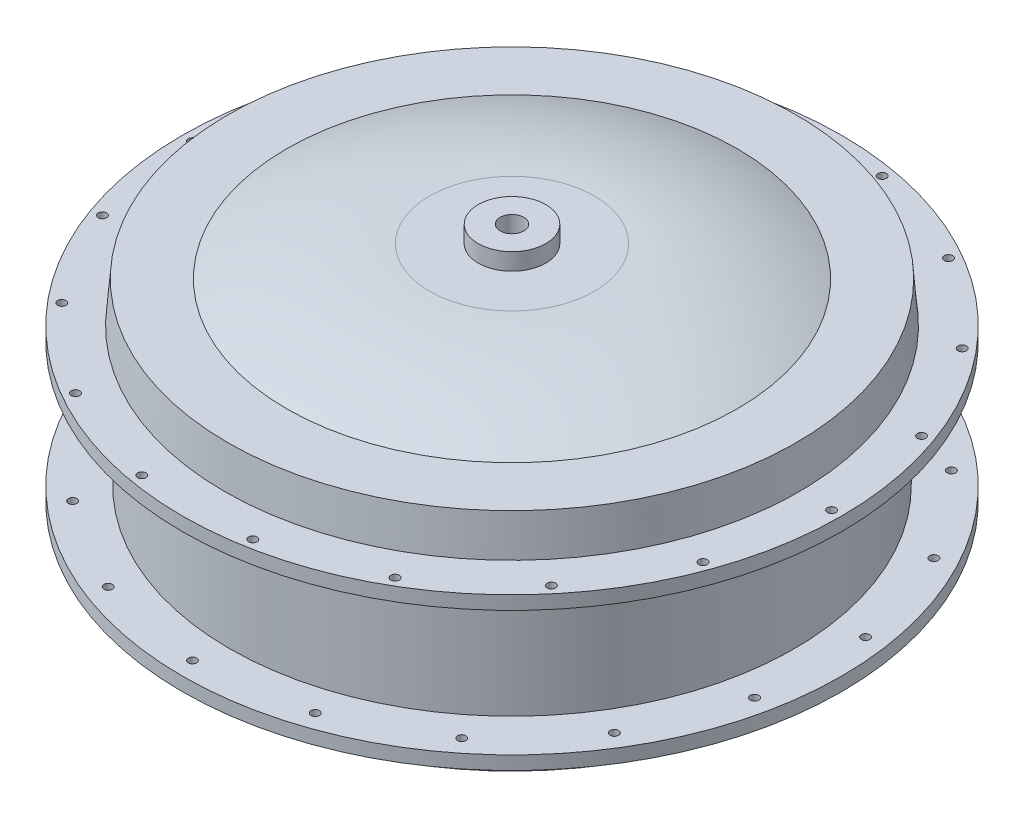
ISO-10303-21;
HEADER;
FILE_DESCRIPTION(('STEP AP214'),'2;1');
FILE_NAME('part.step','',(''),(''),'','','');
FILE_SCHEMA(('AUTOMOTIVE_DESIGN { 1 0 10303 214 1 1 1 1 }'));
ENDSEC;
DATA;
#1=APPLICATION_CONTEXT('core data for automotive mechanical design processes');
#2=APPLICATION_PROTOCOL_DEFINITION('international standard','automotive_design',2000,#1);
#3=PRODUCT_CONTEXT('',#1,'mechanical');
#4=PRODUCT('Part','Part','',(#3));
#5=PRODUCT_RELATED_PRODUCT_CATEGORY('part','',(#4));
#6=PRODUCT_DEFINITION_FORMATION('','',#4);
#7=PRODUCT_DEFINITION_CONTEXT('part definition',#1,'design');
#8=PRODUCT_DEFINITION('design','',#6,#7);
#9=PRODUCT_DEFINITION_SHAPE('','',#8);
#10=(LENGTH_UNIT() NAMED_UNIT(*) SI_UNIT(.MILLI.,.METRE.));
#11=(NAMED_UNIT(*) PLANE_ANGLE_UNIT() SI_UNIT($,.RADIAN.));
#12=(NAMED_UNIT(*) SI_UNIT($,.STERADIAN.) SOLID_ANGLE_UNIT());
#13=UNCERTAINTY_MEASURE_WITH_UNIT(LENGTH_MEASURE(1.E-05),#10,'distance_accuracy_value','');
#14=(GEOMETRIC_REPRESENTATION_CONTEXT(3) GLOBAL_UNCERTAINTY_ASSIGNED_CONTEXT((#13)) GLOBAL_UNIT_ASSIGNED_CONTEXT((#10,
#11,#12)) REPRESENTATION_CONTEXT('',''));
#15=CARTESIAN_POINT('',(0.,0.,0.));
#16=DIRECTION('',(0.,0.,1.));
#17=DIRECTION('',(1.,0.,0.));
#18=AXIS2_PLACEMENT_3D('',#15,#16,#17);
#19=CARTESIAN_POINT('',(87.5,-12.0021427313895,0.));
#20=DIRECTION('',(0.,1.,0.));
#21=DIRECTION('',(0.,0.,1.));
#22=AXIS2_PLACEMENT_3D('',#19,#20,#21);
#23=PLANE('',#22);
#24=CARTESIAN_POINT('',(2.49999999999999,-12.0021427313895,0.));
#25=DIRECTION('',(0.,1.,0.));
#26=DIRECTION('',(0.,0.,1.));
#27=AXIS2_PLACEMENT_3D('',#24,#25,#26);
#28=CIRCLE('',#27,85.);
#29=CARTESIAN_POINT('',(2.49999999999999,-12.0021427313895,85.));
#30=VERTEX_POINT('',#29);
#31=EDGE_CURVE('E10',#30,#30,#28,.T.);
#32=ORIENTED_EDGE('',*,*,#31,.F.);
#33=EDGE_LOOP('',(#32));
#34=FACE_BOUND('',#33,.T.);
#35=CARTESIAN_POINT('',(2.49999999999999,-12.0021427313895,0.));
#36=DIRECTION('',(0.,1.,0.));
#37=DIRECTION('',(0.,0.,1.));
#38=AXIS2_PLACEMENT_3D('',#35,#36,#37);
#39=CIRCLE('',#38,76.5);
#40=CARTESIAN_POINT('',(2.49999999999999,-12.0021427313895,76.5));
#41=VERTEX_POINT('',#40);
#42=EDGE_CURVE('E412',#41,#41,#39,.T.);
#43=ORIENTED_EDGE('',*,*,#42,.T.);
#44=EDGE_LOOP('',(#43));
#45=FACE_BOUND('',#44,.T.);
#46=ADVANCED_FACE('F348',(#34,#45),#23,.F.);
#47=CARTESIAN_POINT('',(2.49999999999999,40.,0.));
#48=DIRECTION('',(0.,1.,0.));
#49=DIRECTION('',(0.,0.,1.));
#50=AXIS2_PLACEMENT_3D('',#47,#48,#49);
#51=CYLINDRICAL_SURFACE('',#50,85.);
#52=CARTESIAN_POINT('',(2.49999999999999,-3.00000000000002,0.));
#53=DIRECTION('',(0.,1.,0.));
#54=DIRECTION('',(0.,0.,1.));
#55=AXIS2_PLACEMENT_3D('',#52,#53,#54);
#56=CIRCLE('',#55,85.);
#57=CARTESIAN_POINT('',(2.49999999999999,-3.00000000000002,85.));
#58=VERTEX_POINT('',#57);
#59=EDGE_CURVE('E354',#58,#58,#56,.T.);
#60=ORIENTED_EDGE('',*,*,#59,.F.);
#61=EDGE_LOOP('',(#60));
#62=FACE_BOUND('',#61,.T.);
#63=ORIENTED_EDGE('',*,*,#31,.T.);
#64=EDGE_LOOP('',(#63));
#65=FACE_BOUND('',#64,.T.);
#66=ADVANCED_FACE('F698',(#62,#65),#51,.T.);
#67=CARTESIAN_POINT('',(87.5,-3.00000000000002,0.));
#68=DIRECTION('',(0.,1.,0.));
#69=DIRECTION('',(0.,0.,1.));
#70=AXIS2_PLACEMENT_3D('',#67,#68,#69);
#71=PLANE('',#70);
#72=CARTESIAN_POINT('',(31.6166216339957,-3.00000000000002,87.3067714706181));
#73=DIRECTION('',(0.,-1.,0.));
#74=DIRECTION('',(0.939692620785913,0.,-0.342020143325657));
#75=AXIS2_PLACEMENT_3D('',#72,#73,#74);
#76=CIRCLE('',#75,1.25);
#77=CARTESIAN_POINT('',(32.791237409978,-3.00000000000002,86.879246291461));
#78=VERTEX_POINT('',#77);
#79=EDGE_CURVE('E518',#78,#78,#76,.T.);
#80=ORIENTED_EDGE('',*,*,#79,.F.);
#81=EDGE_LOOP('',(#80));
#82=FACE_BOUND('',#81,.T.);
#83=CARTESIAN_POINT('',(59.7213489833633,-3.00000000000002,72.083057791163));
#84=DIRECTION('',(0.,-1.,0.));
#85=DIRECTION('',(0.766044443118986,0.,-0.64278760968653));
#86=AXIS2_PLACEMENT_3D('',#83,#84,#85);
#87=CIRCLE('',#86,1.25);
#88=CARTESIAN_POINT('',(60.678904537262,-3.00000000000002,71.2795732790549));
#89=VERTEX_POINT('',#88);
#90=EDGE_CURVE('E512',#89,#89,#87,.T.);
#91=ORIENTED_EDGE('',*,*,#90,.F.);
#92=EDGE_LOOP('',(#91));
#93=FACE_BOUND('',#92,.T.);
#94=CARTESIAN_POINT('',(80.9243371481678,-3.00000000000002,48.165063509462));
#95=DIRECTION('',(0.,-1.,0.));
#96=DIRECTION('',(0.50000000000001,0.,-0.866025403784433));
#97=AXIS2_PLACEMENT_3D('',#94,#95,#96);
#98=CIRCLE('',#97,1.25);
#99=CARTESIAN_POINT('',(81.5493371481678,-3.00000000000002,47.0825317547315));
#100=VERTEX_POINT('',#99);
#101=EDGE_CURVE('E506',#100,#100,#98,.T.);
#102=ORIENTED_EDGE('',*,*,#101,.F.);
#103=EDGE_LOOP('',(#102));
#104=FACE_BOUND('',#103,.T.);
#105=CARTESIAN_POINT('',(92.6681928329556,-3.00000000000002,18.437651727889));
#106=DIRECTION('',(0.,-1.,0.));
#107=DIRECTION('',(0.17364817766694,0.,-0.984807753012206));
#108=AXIS2_PLACEMENT_3D('',#105,#106,#107);
#109=CIRCLE('',#108,1.25);
#110=CARTESIAN_POINT('',(92.8852530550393,-3.00000000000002,17.2066420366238));
#111=VERTEX_POINT('',#110);
#112=EDGE_CURVE('E500',#111,#111,#109,.T.);
#113=ORIENTED_EDGE('',*,*,#112,.F.);
#114=EDGE_LOOP('',(#113));
#115=FACE_BOUND('',#114,.T.);
#116=CARTESIAN_POINT('',(93.5364337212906,-3.00000000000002,-13.5136129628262));
#117=DIRECTION('',(0.,-1.,0.));
#118=DIRECTION('',(-0.173648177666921,0.,-0.98480775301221));
#119=AXIS2_PLACEMENT_3D('',#116,#117,#118);
#120=CIRCLE('',#119,1.25);
#121=CARTESIAN_POINT('',(93.3193734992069,-3.00000000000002,-14.7446226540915));
#122=VERTEX_POINT('',#121);
#123=EDGE_CURVE('E494',#122,#122,#120,.T.);
#124=ORIENTED_EDGE('',*,*,#123,.F.);
#125=EDGE_LOOP('',(#124));
#126=FACE_BOUND('',#125,.T.);
#127=CARTESIAN_POINT('',(83.4243371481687,-3.00000000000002,-43.8349364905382));
#128=DIRECTION('',(0.,-1.,0.));
#129=DIRECTION('',(-0.499999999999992,0.,-0.866025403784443));
#130=AXIS2_PLACEMENT_3D('',#127,#128,#129);
#131=CIRCLE('',#130,1.25);
#132=CARTESIAN_POINT('',(82.7993371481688,-3.00000000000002,-44.9174682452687));
#133=VERTEX_POINT('',#132);
#134=EDGE_CURVE('E488',#133,#133,#131,.T.);
#135=ORIENTED_EDGE('',*,*,#134,.F.);
#136=EDGE_LOOP('',(#135));
#137=FACE_BOUND('',#136,.T.);
#138=CARTESIAN_POINT('',(63.5515711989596,-3.00000000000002,-68.8691197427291));
#139=DIRECTION('',(0.,-1.,0.));
#140=DIRECTION('',(-0.766044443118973,0.,-0.642787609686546));
#141=AXIS2_PLACEMENT_3D('',#138,#139,#140);
#142=CIRCLE('',#141,1.25);
#143=CARTESIAN_POINT('',(62.5940156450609,-3.00000000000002,-69.6726042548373));
#144=VERTEX_POINT('',#143);
#145=EDGE_CURVE('E482',#144,#144,#142,.T.);
#146=ORIENTED_EDGE('',*,*,#145,.F.);
#147=EDGE_LOOP('',(#146));
#148=FACE_BOUND('',#147,.T.);
#149=CARTESIAN_POINT('',(36.3150847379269,-3.00000000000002,-85.5966707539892));
#150=DIRECTION('',(0.,-1.,0.));
#151=DIRECTION('',(-0.939692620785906,0.,-0.342020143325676));
#152=AXIS2_PLACEMENT_3D('',#149,#150,#151);
#153=CIRCLE('',#152,1.25);
#154=CARTESIAN_POINT('',(35.1404689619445,-3.00000000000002,-86.0241959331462));
#155=VERTEX_POINT('',#154);
#156=EDGE_CURVE('E476',#155,#155,#153,.T.);
#157=ORIENTED_EDGE('',*,*,#156,.F.);
#158=EDGE_LOOP('',(#157));
#159=FACE_BOUND('',#158,.T.);
#160=CARTESIAN_POINT('',(5.00000000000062,-3.00000000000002,-92.));
#161=DIRECTION('',(0.,-1.,0.));
#162=DIRECTION('',(-1.,0.,0.));
#163=AXIS2_PLACEMENT_3D('',#160,#161,#162);
#164=CIRCLE('',#163,1.25);
#165=CARTESIAN_POINT('',(3.75000000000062,-3.00000000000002,-92.));
#166=VERTEX_POINT('',#165);
#167=EDGE_CURVE('E470',#166,#166,#164,.T.);
#168=ORIENTED_EDGE('',*,*,#167,.F.);
#169=EDGE_LOOP('',(#168));
#170=FACE_BOUND('',#169,.T.);
#171=CARTESIAN_POINT('',(-26.6166216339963,-3.00000000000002,-87.3067714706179));
#172=DIRECTION('',(0.,-1.,0.));
#173=DIRECTION('',(-0.939692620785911,0.,0.342020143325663));
#174=AXIS2_PLACEMENT_3D('',#171,#172,#173);
#175=CIRCLE('',#174,1.25);
#176=CARTESIAN_POINT('',(-27.7912374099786,-3.00000000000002,-86.8792462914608));
#177=VERTEX_POINT('',#176);
#178=EDGE_CURVE('E464',#177,#177,#175,.T.);
#179=ORIENTED_EDGE('',*,*,#178,.F.);
#180=EDGE_LOOP('',(#179));
#181=FACE_BOUND('',#180,.T.);
#182=CARTESIAN_POINT('',(-54.7213489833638,-3.00000000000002,-72.0830577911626));
#183=DIRECTION('',(0.,-1.,0.));
#184=DIRECTION('',(-0.766044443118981,0.,0.642787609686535));
#185=AXIS2_PLACEMENT_3D('',#182,#183,#184);
#186=CIRCLE('',#185,1.25);
#187=CARTESIAN_POINT('',(-55.6789045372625,-3.00000000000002,-71.2795732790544));
#188=VERTEX_POINT('',#187);
#189=EDGE_CURVE('E458',#188,#188,#186,.T.);
#190=ORIENTED_EDGE('',*,*,#189,.F.);
#191=EDGE_LOOP('',(#190));
#192=FACE_BOUND('',#191,.T.);
#193=CARTESIAN_POINT('',(-75.9243371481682,-3.00000000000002,-48.1650635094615));
#194=DIRECTION('',(0.,-1.,0.));
#195=DIRECTION('',(-0.500000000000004,0.,0.866025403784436));
#196=AXIS2_PLACEMENT_3D('',#193,#194,#195);
#197=CIRCLE('',#196,1.25);
#198=CARTESIAN_POINT('',(-76.5493371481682,-3.00000000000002,-47.0825317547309));
#199=VERTEX_POINT('',#198);
#200=EDGE_CURVE('E452',#199,#199,#197,.T.);
#201=ORIENTED_EDGE('',*,*,#200,.F.);
#202=EDGE_LOOP('',(#201));
#203=FACE_BOUND('',#202,.T.);
#204=CARTESIAN_POINT('',(-87.6681928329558,-3.00000000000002,-18.4376517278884));
#205=DIRECTION('',(0.,-1.,0.));
#206=DIRECTION('',(-0.173648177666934,0.,0.984807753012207));
#207=AXIS2_PLACEMENT_3D('',#204,#205,#206);
#208=CIRCLE('',#207,1.25);
#209=CARTESIAN_POINT('',(-87.8852530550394,-3.00000000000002,-17.2066420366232));
#210=VERTEX_POINT('',#209);
#211=EDGE_CURVE('E446',#210,#210,#208,.T.);
#212=ORIENTED_EDGE('',*,*,#211,.F.);
#213=EDGE_LOOP('',(#212));
#214=FACE_BOUND('',#213,.T.);
#215=CARTESIAN_POINT('',(-88.5364337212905,-3.00000000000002,13.5136129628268));
#216=DIRECTION('',(0.,-1.,0.));
#217=DIRECTION('',(0.173648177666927,0.,0.984807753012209));
#218=AXIS2_PLACEMENT_3D('',#215,#216,#217);
#219=CIRCLE('',#218,1.25);
#220=CARTESIAN_POINT('',(-88.3193734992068,-3.00000000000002,14.7446226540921));
#221=VERTEX_POINT('',#220);
#222=EDGE_CURVE('E440',#221,#221,#219,.T.);
#223=ORIENTED_EDGE('',*,*,#222,.F.);
#224=EDGE_LOOP('',(#223));
#225=FACE_BOUND('',#224,.T.);
#226=CARTESIAN_POINT('',(-78.4243371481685,-3.00000000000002,43.8349364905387));
#227=DIRECTION('',(0.,-1.,0.));
#228=DIRECTION('',(0.499999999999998,0.,0.86602540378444));
#229=AXIS2_PLACEMENT_3D('',#226,#227,#228);
#230=CIRCLE('',#229,1.25);
#231=CARTESIAN_POINT('',(-77.7993371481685,-3.00000000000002,44.9174682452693));
#232=VERTEX_POINT('',#231);
#233=EDGE_CURVE('E434',#232,#232,#230,.T.);
#234=ORIENTED_EDGE('',*,*,#233,.F.);
#235=EDGE_LOOP('',(#234));
#236=FACE_BOUND('',#235,.T.);
#237=CARTESIAN_POINT('',(-58.5515711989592,-3.00000000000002,68.8691197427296));
#238=DIRECTION('',(0.,-1.,0.));
#239=DIRECTION('',(0.766044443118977,0.,0.642787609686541));
#240=AXIS2_PLACEMENT_3D('',#237,#238,#239);
#241=CIRCLE('',#240,1.25);
#242=CARTESIAN_POINT('',(-57.5940156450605,-3.00000000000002,69.6726042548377));
#243=VERTEX_POINT('',#242);
#244=EDGE_CURVE('E428',#243,#243,#241,.T.);
#245=ORIENTED_EDGE('',*,*,#244,.F.);
#246=EDGE_LOOP('',(#245));
#247=FACE_BOUND('',#246,.T.);
#248=CARTESIAN_POINT('',(-31.3150847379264,-3.00000000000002,85.5966707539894));
#249=DIRECTION('',(0.,-1.,0.));
#250=DIRECTION('',(0.939692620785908,0.,0.342020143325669));
#251=AXIS2_PLACEMENT_3D('',#248,#249,#250);
#252=CIRCLE('',#251,1.25);
#253=CARTESIAN_POINT('',(-30.140468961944,-3.00000000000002,86.0241959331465));
#254=VERTEX_POINT('',#253);
#255=EDGE_CURVE('E422',#254,#254,#252,.T.);
#256=ORIENTED_EDGE('',*,*,#255,.F.);
#257=EDGE_LOOP('',(#256));
#258=FACE_BOUND('',#257,.T.);
#259=CARTESIAN_POINT('',(0.,-3.00000000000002,92.));
#260=DIRECTION('',(0.,-1.,0.));
#261=DIRECTION('',(1.,0.,0.));
#262=AXIS2_PLACEMENT_3D('',#259,#260,#261);
#263=CIRCLE('',#262,1.25);
#264=CARTESIAN_POINT('',(1.25,-3.00000000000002,92.));
#265=VERTEX_POINT('',#264);
#266=EDGE_CURVE('E416',#265,#265,#263,.T.);
#267=ORIENTED_EDGE('',*,*,#266,.F.);
#268=EDGE_LOOP('',(#267));
#269=FACE_BOUND('',#268,.T.);
#270=CARTESIAN_POINT('',(2.49999999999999,-3.00000000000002,0.));
#271=DIRECTION('',(0.,1.,0.));
#272=DIRECTION('',(0.,0.,1.));
#273=AXIS2_PLACEMENT_3D('',#270,#271,#272);
#274=CIRCLE('',#273,97.5);
#275=CARTESIAN_POINT('',(2.49999999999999,-3.00000000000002,97.5));
#276=VERTEX_POINT('',#275);
#277=EDGE_CURVE('E358',#276,#276,#274,.T.);
#278=ORIENTED_EDGE('',*,*,#277,.F.);
#279=EDGE_LOOP('',(#278));
#280=FACE_BOUND('',#279,.T.);
#281=ORIENTED_EDGE('',*,*,#59,.T.);
#282=EDGE_LOOP('',(#281));
#283=FACE_BOUND('',#282,.T.);
#284=ADVANCED_FACE('F693',(#82,#93,#104,#115,#126,#137,#148,#159,#170,#181,#192,#203,#214,#225,
#236,#247,#258,#269,#280,#283),#71,.F.);
#285=CARTESIAN_POINT('',(2.49999999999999,40.,0.));
#286=DIRECTION('',(0.,1.,0.));
#287=DIRECTION('',(0.,0.,1.));
#288=AXIS2_PLACEMENT_3D('',#285,#286,#287);
#289=CYLINDRICAL_SURFACE('',#288,97.5);
#290=CARTESIAN_POINT('',(2.49999999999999,0.99999999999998,0.));
#291=DIRECTION('',(0.,1.,0.));
#292=DIRECTION('',(0.,0.,1.));
#293=AXIS2_PLACEMENT_3D('',#290,#291,#292);
#294=CIRCLE('',#293,97.5);
#295=CARTESIAN_POINT('',(2.49999999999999,0.99999999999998,97.5));
#296=VERTEX_POINT('',#295);
#297=EDGE_CURVE('E362',#296,#296,#294,.T.);
#298=ORIENTED_EDGE('',*,*,#297,.F.);
#299=EDGE_LOOP('',(#298));
#300=FACE_BOUND('',#299,.T.);
#301=ORIENTED_EDGE('',*,*,#277,.T.);
#302=EDGE_LOOP('',(#301));
#303=FACE_BOUND('',#302,.T.);
#304=ADVANCED_FACE('F686',(#300,#303),#289,.T.);
#305=CARTESIAN_POINT('',(100.,0.999999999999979,0.));
#306=DIRECTION('',(0.,-1.,0.));
#307=DIRECTION('',(0.,0.,-1.));
#308=AXIS2_PLACEMENT_3D('',#305,#306,#307);
#309=PLANE('',#308);
#310=CARTESIAN_POINT('',(31.6166216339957,0.999999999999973,87.3067714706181));
#311=DIRECTION('',(0.,-1.,0.));
#312=DIRECTION('',(0.,0.,-1.));
#313=AXIS2_PLACEMENT_3D('',#310,#311,#312);
#314=CIRCLE('',#313,1.25);
#315=CARTESIAN_POINT('',(31.6166216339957,0.999999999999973,86.0567714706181));
#316=VERTEX_POINT('',#315);
#317=EDGE_CURVE('E515',#316,#316,#314,.F.);
#318=ORIENTED_EDGE('',*,*,#317,.F.);
#319=EDGE_LOOP('',(#318));
#320=FACE_BOUND('',#319,.T.);
#321=CARTESIAN_POINT('',(59.7213489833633,0.999999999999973,72.083057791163));
#322=DIRECTION('',(0.,-1.,0.));
#323=DIRECTION('',(0.,0.,-1.));
#324=AXIS2_PLACEMENT_3D('',#321,#322,#323);
#325=CIRCLE('',#324,1.25);
#326=CARTESIAN_POINT('',(59.7213489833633,0.999999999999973,70.833057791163));
#327=VERTEX_POINT('',#326);
#328=EDGE_CURVE('E509',#327,#327,#325,.F.);
#329=ORIENTED_EDGE('',*,*,#328,.F.);
#330=EDGE_LOOP('',(#329));
#331=FACE_BOUND('',#330,.T.);
#332=CARTESIAN_POINT('',(80.9243371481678,0.999999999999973,48.165063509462));
#333=DIRECTION('',(0.,-1.,0.));
#334=DIRECTION('',(0.,0.,-1.));
#335=AXIS2_PLACEMENT_3D('',#332,#333,#334);
#336=CIRCLE('',#335,1.25);
#337=CARTESIAN_POINT('',(80.9243371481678,0.999999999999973,46.915063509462));
#338=VERTEX_POINT('',#337);
#339=EDGE_CURVE('E503',#338,#338,#336,.F.);
#340=ORIENTED_EDGE('',*,*,#339,.F.);
#341=EDGE_LOOP('',(#340));
#342=FACE_BOUND('',#341,.T.);
#343=CARTESIAN_POINT('',(92.6681928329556,0.999999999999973,18.437651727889));
#344=DIRECTION('',(0.,-1.,0.));
#345=DIRECTION('',(0.,0.,-1.));
#346=AXIS2_PLACEMENT_3D('',#343,#344,#345);
#347=CIRCLE('',#346,1.25);
#348=CARTESIAN_POINT('',(92.6681928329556,0.999999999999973,17.187651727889));
#349=VERTEX_POINT('',#348);
#350=EDGE_CURVE('E497',#349,#349,#347,.F.);
#351=ORIENTED_EDGE('',*,*,#350,.F.);
#352=EDGE_LOOP('',(#351));
#353=FACE_BOUND('',#352,.T.);
#354=CARTESIAN_POINT('',(93.5364337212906,0.999999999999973,-13.5136129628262));
#355=DIRECTION('',(0.,-1.,0.));
#356=DIRECTION('',(0.,0.,-1.));
#357=AXIS2_PLACEMENT_3D('',#354,#355,#356);
#358=CIRCLE('',#357,1.25);
#359=CARTESIAN_POINT('',(93.5364337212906,0.999999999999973,-14.7636129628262));
#360=VERTEX_POINT('',#359);
#361=EDGE_CURVE('E491',#360,#360,#358,.F.);
#362=ORIENTED_EDGE('',*,*,#361,.F.);
#363=EDGE_LOOP('',(#362));
#364=FACE_BOUND('',#363,.T.);
#365=CARTESIAN_POINT('',(83.4243371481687,0.999999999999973,-43.8349364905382));
#366=DIRECTION('',(0.,-1.,0.));
#367=DIRECTION('',(0.,0.,-1.));
#368=AXIS2_PLACEMENT_3D('',#365,#366,#367);
#369=CIRCLE('',#368,1.25);
#370=CARTESIAN_POINT('',(83.4243371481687,0.999999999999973,-45.0849364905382));
#371=VERTEX_POINT('',#370);
#372=EDGE_CURVE('E485',#371,#371,#369,.F.);
#373=ORIENTED_EDGE('',*,*,#372,.F.);
#374=EDGE_LOOP('',(#373));
#375=FACE_BOUND('',#374,.T.);
#376=CARTESIAN_POINT('',(63.5515711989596,0.999999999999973,-68.8691197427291));
#377=DIRECTION('',(0.,-1.,0.));
#378=DIRECTION('',(0.,0.,-1.));
#379=AXIS2_PLACEMENT_3D('',#376,#377,#378);
#380=CIRCLE('',#379,1.25);
#381=CARTESIAN_POINT('',(63.5515711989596,0.999999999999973,-70.1191197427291));
#382=VERTEX_POINT('',#381);
#383=EDGE_CURVE('E479',#382,#382,#380,.F.);
#384=ORIENTED_EDGE('',*,*,#383,.F.);
#385=EDGE_LOOP('',(#384));
#386=FACE_BOUND('',#385,.T.);
#387=CARTESIAN_POINT('',(36.3150847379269,0.999999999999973,-85.5966707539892));
#388=DIRECTION('',(0.,-1.,0.));
#389=DIRECTION('',(0.,0.,-1.));
#390=AXIS2_PLACEMENT_3D('',#387,#388,#389);
#391=CIRCLE('',#390,1.25);
#392=CARTESIAN_POINT('',(36.3150847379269,0.999999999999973,-86.8466707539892));
#393=VERTEX_POINT('',#392);
#394=EDGE_CURVE('E473',#393,#393,#391,.F.);
#395=ORIENTED_EDGE('',*,*,#394,.F.);
#396=EDGE_LOOP('',(#395));
#397=FACE_BOUND('',#396,.T.);
#398=CARTESIAN_POINT('',(5.00000000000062,0.999999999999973,-92.));
#399=DIRECTION('',(0.,-1.,0.));
#400=DIRECTION('',(0.,0.,-1.));
#401=AXIS2_PLACEMENT_3D('',#398,#399,#400);
#402=CIRCLE('',#401,1.25);
#403=CARTESIAN_POINT('',(5.00000000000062,0.999999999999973,-93.25));
#404=VERTEX_POINT('',#403);
#405=EDGE_CURVE('E467',#404,#404,#402,.F.);
#406=ORIENTED_EDGE('',*,*,#405,.F.);
#407=EDGE_LOOP('',(#406));
#408=FACE_BOUND('',#407,.T.);
#409=CARTESIAN_POINT('',(-26.6166216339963,0.999999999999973,-87.3067714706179));
#410=DIRECTION('',(0.,-1.,0.));
#411=DIRECTION('',(0.,0.,-1.));
#412=AXIS2_PLACEMENT_3D('',#409,#410,#411);
#413=CIRCLE('',#412,1.25);
#414=CARTESIAN_POINT('',(-26.6166216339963,0.999999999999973,-88.5567714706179));
#415=VERTEX_POINT('',#414);
#416=EDGE_CURVE('E461',#415,#415,#413,.F.);
#417=ORIENTED_EDGE('',*,*,#416,.F.);
#418=EDGE_LOOP('',(#417));
#419=FACE_BOUND('',#418,.T.);
#420=CARTESIAN_POINT('',(-54.7213489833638,0.999999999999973,-72.0830577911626));
#421=DIRECTION('',(0.,-1.,0.));
#422=DIRECTION('',(0.,0.,-1.));
#423=AXIS2_PLACEMENT_3D('',#420,#421,#422);
#424=CIRCLE('',#423,1.25);
#425=CARTESIAN_POINT('',(-54.7213489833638,0.999999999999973,-73.3330577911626));
#426=VERTEX_POINT('',#425);
#427=EDGE_CURVE('E455',#426,#426,#424,.F.);
#428=ORIENTED_EDGE('',*,*,#427,.F.);
#429=EDGE_LOOP('',(#428));
#430=FACE_BOUND('',#429,.T.);
#431=CARTESIAN_POINT('',(-75.9243371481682,0.999999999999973,-48.1650635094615));
#432=DIRECTION('',(0.,-1.,0.));
#433=DIRECTION('',(0.,0.,-1.));
#434=AXIS2_PLACEMENT_3D('',#431,#432,#433);
#435=CIRCLE('',#434,1.25);
#436=CARTESIAN_POINT('',(-75.9243371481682,0.999999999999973,-49.4150635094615));
#437=VERTEX_POINT('',#436);
#438=EDGE_CURVE('E449',#437,#437,#435,.F.);
#439=ORIENTED_EDGE('',*,*,#438,.F.);
#440=EDGE_LOOP('',(#439));
#441=FACE_BOUND('',#440,.T.);
#442=CARTESIAN_POINT('',(-87.6681928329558,0.999999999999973,-18.4376517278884));
#443=DIRECTION('',(0.,-1.,0.));
#444=DIRECTION('',(0.,0.,-1.));
#445=AXIS2_PLACEMENT_3D('',#442,#443,#444);
#446=CIRCLE('',#445,1.25);
#447=CARTESIAN_POINT('',(-87.6681928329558,0.999999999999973,-19.6876517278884));
#448=VERTEX_POINT('',#447);
#449=EDGE_CURVE('E443',#448,#448,#446,.F.);
#450=ORIENTED_EDGE('',*,*,#449,.F.);
#451=EDGE_LOOP('',(#450));
#452=FACE_BOUND('',#451,.T.);
#453=CARTESIAN_POINT('',(-88.5364337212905,0.999999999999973,13.5136129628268));
#454=DIRECTION('',(0.,-1.,0.));
#455=DIRECTION('',(0.,0.,-1.));
#456=AXIS2_PLACEMENT_3D('',#453,#454,#455);
#457=CIRCLE('',#456,1.25);
#458=CARTESIAN_POINT('',(-88.5364337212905,0.999999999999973,12.2636129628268));
#459=VERTEX_POINT('',#458);
#460=EDGE_CURVE('E437',#459,#459,#457,.F.);
#461=ORIENTED_EDGE('',*,*,#460,.F.);
#462=EDGE_LOOP('',(#461));
#463=FACE_BOUND('',#462,.T.);
#464=CARTESIAN_POINT('',(-78.4243371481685,0.999999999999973,43.8349364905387));
#465=DIRECTION('',(0.,-1.,0.));
#466=DIRECTION('',(0.,0.,-1.));
#467=AXIS2_PLACEMENT_3D('',#464,#465,#466);
#468=CIRCLE('',#467,1.25);
#469=CARTESIAN_POINT('',(-78.4243371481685,0.999999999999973,42.5849364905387));
#470=VERTEX_POINT('',#469);
#471=EDGE_CURVE('E431',#470,#470,#468,.F.);
#472=ORIENTED_EDGE('',*,*,#471,.F.);
#473=EDGE_LOOP('',(#472));
#474=FACE_BOUND('',#473,.T.);
#475=CARTESIAN_POINT('',(-58.5515711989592,0.999999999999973,68.8691197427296));
#476=DIRECTION('',(0.,-1.,0.));
#477=DIRECTION('',(0.,0.,-1.));
#478=AXIS2_PLACEMENT_3D('',#475,#476,#477);
#479=CIRCLE('',#478,1.25);
#480=CARTESIAN_POINT('',(-58.5515711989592,0.999999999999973,67.6191197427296));
#481=VERTEX_POINT('',#480);
#482=EDGE_CURVE('E425',#481,#481,#479,.F.);
#483=ORIENTED_EDGE('',*,*,#482,.F.);
#484=EDGE_LOOP('',(#483));
#485=FACE_BOUND('',#484,.T.);
#486=CARTESIAN_POINT('',(-31.3150847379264,0.999999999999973,85.5966707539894));
#487=DIRECTION('',(0.,-1.,0.));
#488=DIRECTION('',(0.,0.,-1.));
#489=AXIS2_PLACEMENT_3D('',#486,#487,#488);
#490=CIRCLE('',#489,1.25);
#491=CARTESIAN_POINT('',(-31.3150847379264,0.999999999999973,84.3466707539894));
#492=VERTEX_POINT('',#491);
#493=EDGE_CURVE('E419',#492,#492,#490,.F.);
#494=ORIENTED_EDGE('',*,*,#493,.F.);
#495=EDGE_LOOP('',(#494));
#496=FACE_BOUND('',#495,.T.);
#497=CARTESIAN_POINT('',(0.,0.999999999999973,92.));
#498=DIRECTION('',(0.,-1.,0.));
#499=DIRECTION('',(0.,0.,-1.));
#500=AXIS2_PLACEMENT_3D('',#497,#498,#499);
#501=CIRCLE('',#500,1.25);
#502=CARTESIAN_POINT('',(0.,0.999999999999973,90.75));
#503=VERTEX_POINT('',#502);
#504=EDGE_CURVE('E415',#503,#503,#501,.F.);
#505=ORIENTED_EDGE('',*,*,#504,.F.);
#506=EDGE_LOOP('',(#505));
#507=FACE_BOUND('',#506,.T.);
#508=CARTESIAN_POINT('',(2.49999999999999,0.99999999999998,0.));
#509=DIRECTION('',(0.,1.,0.));
#510=DIRECTION('',(0.,0.,1.));
#511=AXIS2_PLACEMENT_3D('',#508,#509,#510);
#512=CIRCLE('',#511,83.5);
#513=CARTESIAN_POINT('',(2.49999999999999,0.99999999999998,83.5));
#514=VERTEX_POINT('',#513);
#515=EDGE_CURVE('E367',#514,#514,#512,.T.);
#516=ORIENTED_EDGE('',*,*,#515,.F.);
#517=EDGE_LOOP('',(#516));
#518=FACE_BOUND('',#517,.T.);
#519=ORIENTED_EDGE('',*,*,#297,.T.);
#520=EDGE_LOOP('',(#519));
#521=FACE_BOUND('',#520,.T.);
#522=ADVANCED_FACE('F680',(#320,#331,#342,#353,#364,#375,#386,#397,#408,#419,#430,#441,#452,
#463,#474,#485,#496,#507,#518,#521),#309,.F.);
#523=CARTESIAN_POINT('',(2.49999999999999,40.,0.));
#524=DIRECTION('',(0.,1.,0.));
#525=DIRECTION('',(0.,0.,1.));
#526=AXIS2_PLACEMENT_3D('',#523,#524,#525);
#527=CYLINDRICAL_SURFACE('',#526,83.5);
#528=CARTESIAN_POINT('',(2.49999999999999,38.,0.));
#529=DIRECTION('',(0.,1.,0.));
#530=DIRECTION('',(0.,0.,1.));
#531=AXIS2_PLACEMENT_3D('',#528,#529,#530);
#532=CIRCLE('',#531,83.5);
#533=CARTESIAN_POINT('',(2.49999999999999,38.,83.5));
#534=VERTEX_POINT('',#533);
#535=EDGE_CURVE('E370',#534,#534,#532,.T.);
#536=ORIENTED_EDGE('',*,*,#535,.F.);
#537=EDGE_LOOP('',(#536));
#538=FACE_BOUND('',#537,.T.);
#539=ORIENTED_EDGE('',*,*,#515,.T.);
#540=EDGE_LOOP('',(#539));
#541=FACE_BOUND('',#540,.T.);
#542=ADVANCED_FACE('F638',(#538,#541),#527,.T.);
#543=CARTESIAN_POINT('',(86.,38.,0.));
#544=DIRECTION('',(0.,1.,0.));
#545=DIRECTION('',(0.,0.,1.));
#546=AXIS2_PLACEMENT_3D('',#543,#544,#545);
#547=PLANE('',#546);
#548=CARTESIAN_POINT('',(-86.3009526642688,38.,32.3209035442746));
#549=DIRECTION('',(0.,1.,0.));
#550=DIRECTION('',(0.,0.,1.));
#551=AXIS2_PLACEMENT_3D('',#548,#549,#550);
#552=CIRCLE('',#551,1.25);
#553=CARTESIAN_POINT('',(-86.3009526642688,38.,33.5709035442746));
#554=VERTEX_POINT('',#553);
#555=EDGE_CURVE('E628',#554,#554,#552,.F.);
#556=ORIENTED_EDGE('',*,*,#555,.F.);
#557=EDGE_LOOP('',(#556));
#558=FACE_BOUND('',#557,.T.);
#559=CARTESIAN_POINT('',(-69.8911998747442,38.,60.7434291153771));
#560=DIRECTION('',(0.,1.,0.));
#561=DIRECTION('',(0.,0.,1.));
#562=AXIS2_PLACEMENT_3D('',#559,#560,#561);
#563=CIRCLE('',#562,1.25);
#564=CARTESIAN_POINT('',(-69.8911998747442,38.,61.9934291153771));
#565=VERTEX_POINT('',#564);
#566=EDGE_CURVE('E622',#565,#565,#563,.F.);
#567=ORIENTED_EDGE('',*,*,#566,.F.);
#568=EDGE_LOOP('',(#567));
#569=FACE_BOUND('',#568,.T.);
#570=CARTESIAN_POINT('',(-44.750000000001,38.,81.8394006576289));
#571=DIRECTION('',(0.,1.,0.));
#572=DIRECTION('',(0.,0.,1.));
#573=AXIS2_PLACEMENT_3D('',#570,#571,#572);
#574=CIRCLE('',#573,1.25);
#575=CARTESIAN_POINT('',(-44.750000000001,38.,83.0894006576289));
#576=VERTEX_POINT('',#575);
#577=EDGE_CURVE('E616',#576,#576,#574,.F.);
#578=ORIENTED_EDGE('',*,*,#577,.F.);
#579=EDGE_LOOP('',(#578));
#580=FACE_BOUND('',#579,.T.);
#581=CARTESIAN_POINT('',(-13.9097527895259,38.,93.0643326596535));
#582=DIRECTION('',(0.,1.,0.));
#583=DIRECTION('',(0.,0.,1.));
#584=AXIS2_PLACEMENT_3D('',#581,#582,#583);
#585=CIRCLE('',#584,1.25);
#586=CARTESIAN_POINT('',(-13.9097527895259,38.,94.3143326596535));
#587=VERTEX_POINT('',#586);
#588=EDGE_CURVE('E610',#587,#587,#585,.F.);
#589=ORIENTED_EDGE('',*,*,#588,.F.);
#590=EDGE_LOOP('',(#589));
#591=FACE_BOUND('',#590,.T.);
#592=CARTESIAN_POINT('',(18.909752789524,38.,93.0643326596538));
#593=DIRECTION('',(0.,1.,0.));
#594=DIRECTION('',(0.,0.,1.));
#595=AXIS2_PLACEMENT_3D('',#592,#593,#594);
#596=CIRCLE('',#595,1.25);
#597=CARTESIAN_POINT('',(18.909752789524,38.,94.3143326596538));
#598=VERTEX_POINT('',#597);
#599=EDGE_CURVE('E604',#598,#598,#596,.F.);
#600=ORIENTED_EDGE('',*,*,#599,.F.);
#601=EDGE_LOOP('',(#600));
#602=FACE_BOUND('',#601,.T.);
#603=CARTESIAN_POINT('',(49.7499999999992,38.,81.8394006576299));
#604=DIRECTION('',(0.,1.,0.));
#605=DIRECTION('',(0.,0.,1.));
#606=AXIS2_PLACEMENT_3D('',#603,#604,#605);
#607=CIRCLE('',#606,1.25);
#608=CARTESIAN_POINT('',(49.7499999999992,38.,83.0894006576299));
#609=VERTEX_POINT('',#608);
#610=EDGE_CURVE('E598',#609,#609,#607,.F.);
#611=ORIENTED_EDGE('',*,*,#610,.F.);
#612=EDGE_LOOP('',(#611));
#613=FACE_BOUND('',#612,.T.);
#614=CARTESIAN_POINT('',(74.8911998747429,38.,60.7434291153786));
#615=DIRECTION('',(0.,1.,0.));
#616=DIRECTION('',(0.,0.,1.));
#617=AXIS2_PLACEMENT_3D('',#614,#615,#616);
#618=CIRCLE('',#617,1.25);
#619=CARTESIAN_POINT('',(74.8911998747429,38.,61.9934291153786));
#620=VERTEX_POINT('',#619);
#621=EDGE_CURVE('E592',#620,#620,#618,.F.);
#622=ORIENTED_EDGE('',*,*,#621,.F.);
#623=EDGE_LOOP('',(#622));
#624=FACE_BOUND('',#623,.T.);
#625=CARTESIAN_POINT('',(91.3009526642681,38.,32.3209035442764));
#626=DIRECTION('',(0.,1.,0.));
#627=DIRECTION('',(0.,0.,1.));
#628=AXIS2_PLACEMENT_3D('',#625,#626,#627);
#629=CIRCLE('',#628,1.25);
#630=CARTESIAN_POINT('',(91.3009526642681,38.,33.5709035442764));
#631=VERTEX_POINT('',#630);
#632=EDGE_CURVE('E586',#631,#631,#629,.F.);
#633=ORIENTED_EDGE('',*,*,#632,.F.);
#634=EDGE_LOOP('',(#633));
#635=FACE_BOUND('',#634,.T.);
#636=CARTESIAN_POINT('',(97.,38.,6.59890355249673E-13));
#637=DIRECTION('',(0.,1.,0.));
#638=DIRECTION('',(0.,0.,1.));
#639=AXIS2_PLACEMENT_3D('',#636,#637,#638);
#640=CIRCLE('',#639,1.25);
#641=CARTESIAN_POINT('',(97.,38.,1.25000000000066));
#642=VERTEX_POINT('',#641);
#643=EDGE_CURVE('E580',#642,#642,#640,.F.);
#644=ORIENTED_EDGE('',*,*,#643,.F.);
#645=EDGE_LOOP('',(#644));
#646=FACE_BOUND('',#645,.T.);
#647=CARTESIAN_POINT('',(91.3009526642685,38.,-32.3209035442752));
#648=DIRECTION('',(0.,1.,0.));
#649=DIRECTION('',(0.,0.,1.));
#650=AXIS2_PLACEMENT_3D('',#647,#648,#649);
#651=CIRCLE('',#650,1.25);
#652=CARTESIAN_POINT('',(91.3009526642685,38.,-31.0709035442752));
#653=VERTEX_POINT('',#652);
#654=EDGE_CURVE('E574',#653,#653,#651,.F.);
#655=ORIENTED_EDGE('',*,*,#654,.F.);
#656=EDGE_LOOP('',(#655));
#657=FACE_BOUND('',#656,.T.);
#658=CARTESIAN_POINT('',(74.8911998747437,38.,-60.7434291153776));
#659=DIRECTION('',(0.,1.,0.));
#660=DIRECTION('',(0.,0.,1.));
#661=AXIS2_PLACEMENT_3D('',#658,#659,#660);
#662=CIRCLE('',#661,1.25);
#663=CARTESIAN_POINT('',(74.8911998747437,38.,-59.4934291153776));
#664=VERTEX_POINT('',#663);
#665=EDGE_CURVE('E568',#664,#664,#662,.F.);
#666=ORIENTED_EDGE('',*,*,#665,.F.);
#667=EDGE_LOOP('',(#666));
#668=FACE_BOUND('',#667,.T.);
#669=CARTESIAN_POINT('',(49.7500000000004,38.,-81.8394006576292));
#670=DIRECTION('',(0.,1.,0.));
#671=DIRECTION('',(0.,0.,1.));
#672=AXIS2_PLACEMENT_3D('',#669,#670,#671);
#673=CIRCLE('',#672,1.25);
#674=CARTESIAN_POINT('',(49.7500000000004,38.,-80.5894006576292));
#675=VERTEX_POINT('',#674);
#676=EDGE_CURVE('E562',#675,#675,#673,.F.);
#677=ORIENTED_EDGE('',*,*,#676,.F.);
#678=EDGE_LOOP('',(#677));
#679=FACE_BOUND('',#678,.T.);
#680=CARTESIAN_POINT('',(18.9097527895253,38.,-93.0643326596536));
#681=DIRECTION('',(0.,1.,0.));
#682=DIRECTION('',(0.,0.,1.));
#683=AXIS2_PLACEMENT_3D('',#680,#681,#682);
#684=CIRCLE('',#683,1.25);
#685=CARTESIAN_POINT('',(18.9097527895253,38.,-91.8143326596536));
#686=VERTEX_POINT('',#685);
#687=EDGE_CURVE('E556',#686,#686,#684,.F.);
#688=ORIENTED_EDGE('',*,*,#687,.F.);
#689=EDGE_LOOP('',(#688));
#690=FACE_BOUND('',#689,.T.);
#691=CARTESIAN_POINT('',(-13.9097527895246,38.,-93.0643326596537));
#692=DIRECTION('',(0.,1.,0.));
#693=DIRECTION('',(0.,0.,1.));
#694=AXIS2_PLACEMENT_3D('',#691,#692,#693);
#695=CIRCLE('',#694,1.25);
#696=CARTESIAN_POINT('',(-13.9097527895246,38.,-91.8143326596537));
#697=VERTEX_POINT('',#696);
#698=EDGE_CURVE('E550',#697,#697,#695,.F.);
#699=ORIENTED_EDGE('',*,*,#698,.F.);
#700=EDGE_LOOP('',(#699));
#701=FACE_BOUND('',#700,.T.);
#702=CARTESIAN_POINT('',(-44.7499999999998,38.,-81.8394006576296));
#703=DIRECTION('',(0.,1.,0.));
#704=DIRECTION('',(0.,0.,1.));
#705=AXIS2_PLACEMENT_3D('',#702,#703,#704);
#706=CIRCLE('',#705,1.25);
#707=CARTESIAN_POINT('',(-44.7499999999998,38.,-80.5894006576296));
#708=VERTEX_POINT('',#707);
#709=EDGE_CURVE('E544',#708,#708,#706,.F.);
#710=ORIENTED_EDGE('',*,*,#709,.F.);
#711=EDGE_LOOP('',(#710));
#712=FACE_BOUND('',#711,.T.);
#713=CARTESIAN_POINT('',(-69.8911998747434,38.,-60.7434291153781));
#714=DIRECTION('',(0.,1.,0.));
#715=DIRECTION('',(0.,0.,1.));
#716=AXIS2_PLACEMENT_3D('',#713,#714,#715);
#717=CIRCLE('',#716,1.25);
#718=CARTESIAN_POINT('',(-69.8911998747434,38.,-59.4934291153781));
#719=VERTEX_POINT('',#718);
#720=EDGE_CURVE('E538',#719,#719,#717,.F.);
#721=ORIENTED_EDGE('',*,*,#720,.F.);
#722=EDGE_LOOP('',(#721));
#723=FACE_BOUND('',#722,.T.);
#724=CARTESIAN_POINT('',(-86.3009526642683,38.,-32.3209035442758));
#725=DIRECTION('',(0.,1.,0.));
#726=DIRECTION('',(0.,0.,1.));
#727=AXIS2_PLACEMENT_3D('',#724,#725,#726);
#728=CIRCLE('',#727,1.25);
#729=CARTESIAN_POINT('',(-86.3009526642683,38.,-31.0709035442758));
#730=VERTEX_POINT('',#729);
#731=EDGE_CURVE('E532',#730,#730,#728,.F.);
#732=ORIENTED_EDGE('',*,*,#731,.F.);
#733=EDGE_LOOP('',(#732));
#734=FACE_BOUND('',#733,.T.);
#735=CARTESIAN_POINT('',(-92.,38.,0.));
#736=DIRECTION('',(0.,1.,0.));
#737=DIRECTION('',(0.,0.,1.));
#738=AXIS2_PLACEMENT_3D('',#735,#736,#737);
#739=CIRCLE('',#738,1.25);
#740=CARTESIAN_POINT('',(-92.,38.,1.25));
#741=VERTEX_POINT('',#740);
#742=EDGE_CURVE('E526',#741,#741,#739,.F.);
#743=ORIENTED_EDGE('',*,*,#742,.F.);
#744=EDGE_LOOP('',(#743));
#745=FACE_BOUND('',#744,.T.);
#746=CARTESIAN_POINT('',(2.49999999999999,38.,0.));
#747=DIRECTION('',(0.,1.,0.));
#748=DIRECTION('',(0.,0.,1.));
#749=AXIS2_PLACEMENT_3D('',#746,#747,#748);
#750=CIRCLE('',#749,97.5);
#751=CARTESIAN_POINT('',(2.49999999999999,38.,97.5));
#752=VERTEX_POINT('',#751);
#753=EDGE_CURVE('E373',#752,#752,#750,.T.);
#754=ORIENTED_EDGE('',*,*,#753,.F.);
#755=EDGE_LOOP('',(#754));
#756=FACE_BOUND('',#755,.T.);
#757=ORIENTED_EDGE('',*,*,#535,.T.);
#758=EDGE_LOOP('',(#757));
#759=FACE_BOUND('',#758,.T.);
#760=ADVANCED_FACE('F634',(#558,#569,#580,#591,#602,#613,#624,#635,#646,#657,#668,#679,#690,
#701,#712,#723,#734,#745,#756,#759),#547,.F.);
#761=CARTESIAN_POINT('',(2.49999999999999,40.,0.));
#762=DIRECTION('',(0.,1.,0.));
#763=DIRECTION('',(0.,0.,1.));
#764=AXIS2_PLACEMENT_3D('',#761,#762,#763);
#765=CYLINDRICAL_SURFACE('',#764,97.5);
#766=CARTESIAN_POINT('',(2.49999999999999,42.,0.));
#767=DIRECTION('',(0.,1.,0.));
#768=DIRECTION('',(0.,0.,1.));
#769=AXIS2_PLACEMENT_3D('',#766,#767,#768);
#770=CIRCLE('',#769,97.5);
#771=CARTESIAN_POINT('',(2.49999999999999,42.,97.5));
#772=VERTEX_POINT('',#771);
#773=EDGE_CURVE('E376',#772,#772,#770,.T.);
#774=ORIENTED_EDGE('',*,*,#773,.F.);
#775=EDGE_LOOP('',(#774));
#776=FACE_BOUND('',#775,.T.);
#777=ORIENTED_EDGE('',*,*,#753,.T.);
#778=EDGE_LOOP('',(#777));
#779=FACE_BOUND('',#778,.T.);
#780=ADVANCED_FACE('F637',(#776,#779),#765,.T.);
#781=CARTESIAN_POINT('',(100.,42.,0.));
#782=DIRECTION('',(0.,-1.,0.));
#783=DIRECTION('',(0.,0.,-1.));
#784=AXIS2_PLACEMENT_3D('',#781,#782,#783);
#785=PLANE('',#784);
#786=CARTESIAN_POINT('',(-86.3009526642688,42.,32.3209035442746));
#787=DIRECTION('',(0.,1.,0.));
#788=DIRECTION('',(-0.939692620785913,0.,0.342020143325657));
#789=AXIS2_PLACEMENT_3D('',#786,#787,#788);
#790=CIRCLE('',#789,1.25);
#791=CARTESIAN_POINT('',(-87.4755684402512,42.,32.7484287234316));
#792=VERTEX_POINT('',#791);
#793=EDGE_CURVE('E625',#792,#792,#790,.T.);
#794=ORIENTED_EDGE('',*,*,#793,.F.);
#795=EDGE_LOOP('',(#794));
#796=FACE_BOUND('',#795,.T.);
#797=CARTESIAN_POINT('',(-69.8911998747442,42.,60.7434291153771));
#798=DIRECTION('',(0.,1.,0.));
#799=DIRECTION('',(-0.766044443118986,0.,0.64278760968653));
#800=AXIS2_PLACEMENT_3D('',#797,#798,#799);
#801=CIRCLE('',#800,1.25);
#802=CARTESIAN_POINT('',(-70.8487554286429,42.,61.5469136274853));
#803=VERTEX_POINT('',#802);
#804=EDGE_CURVE('E619',#803,#803,#801,.T.);
#805=ORIENTED_EDGE('',*,*,#804,.F.);
#806=EDGE_LOOP('',(#805));
#807=FACE_BOUND('',#806,.T.);
#808=CARTESIAN_POINT('',(-44.750000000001,42.,81.8394006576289));
#809=DIRECTION('',(0.,1.,0.));
#810=DIRECTION('',(-0.50000000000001,0.,0.866025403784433));
#811=AXIS2_PLACEMENT_3D('',#808,#809,#810);
#812=CIRCLE('',#811,1.25);
#813=CARTESIAN_POINT('',(-45.375000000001,42.,82.9219324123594));
#814=VERTEX_POINT('',#813);
#815=EDGE_CURVE('E613',#814,#814,#812,.T.);
#816=ORIENTED_EDGE('',*,*,#815,.F.);
#817=EDGE_LOOP('',(#816));
#818=FACE_BOUND('',#817,.T.);
#819=CARTESIAN_POINT('',(-13.9097527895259,42.,93.0643326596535));
#820=DIRECTION('',(0.,1.,0.));
#821=DIRECTION('',(-0.17364817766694,0.,0.984807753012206));
#822=AXIS2_PLACEMENT_3D('',#819,#820,#821);
#823=CIRCLE('',#822,1.25);
#824=CARTESIAN_POINT('',(-14.1268130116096,42.,94.2953423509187));
#825=VERTEX_POINT('',#824);
#826=EDGE_CURVE('E607',#825,#825,#823,.T.);
#827=ORIENTED_EDGE('',*,*,#826,.F.);
#828=EDGE_LOOP('',(#827));
#829=FACE_BOUND('',#828,.T.);
#830=CARTESIAN_POINT('',(18.909752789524,42.,93.0643326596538));
#831=DIRECTION('',(0.,1.,0.));
#832=DIRECTION('',(0.173648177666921,0.,0.98480775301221));
#833=AXIS2_PLACEMENT_3D('',#830,#831,#832);
#834=CIRCLE('',#833,1.25);
#835=CARTESIAN_POINT('',(19.1268130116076,42.,94.2953423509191));
#836=VERTEX_POINT('',#835);
#837=EDGE_CURVE('E601',#836,#836,#834,.T.);
#838=ORIENTED_EDGE('',*,*,#837,.F.);
#839=EDGE_LOOP('',(#838));
#840=FACE_BOUND('',#839,.T.);
#841=CARTESIAN_POINT('',(49.7499999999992,42.,81.8394006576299));
#842=DIRECTION('',(0.,1.,0.));
#843=DIRECTION('',(0.499999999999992,0.,0.866025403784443));
#844=AXIS2_PLACEMENT_3D('',#841,#842,#843);
#845=CIRCLE('',#844,1.25);
#846=CARTESIAN_POINT('',(50.3749999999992,42.,82.9219324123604));
#847=VERTEX_POINT('',#846);
#848=EDGE_CURVE('E595',#847,#847,#845,.T.);
#849=ORIENTED_EDGE('',*,*,#848,.F.);
#850=EDGE_LOOP('',(#849));
#851=FACE_BOUND('',#850,.T.);
#852=CARTESIAN_POINT('',(74.8911998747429,42.,60.7434291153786));
#853=DIRECTION('',(0.,1.,0.));
#854=DIRECTION('',(0.766044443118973,0.,0.642787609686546));
#855=AXIS2_PLACEMENT_3D('',#852,#853,#854);
#856=CIRCLE('',#855,1.25);
#857=CARTESIAN_POINT('',(75.8487554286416,42.,61.5469136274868));
#858=VERTEX_POINT('',#857);
#859=EDGE_CURVE('E589',#858,#858,#856,.T.);
#860=ORIENTED_EDGE('',*,*,#859,.F.);
#861=EDGE_LOOP('',(#860));
#862=FACE_BOUND('',#861,.T.);
#863=CARTESIAN_POINT('',(91.3009526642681,42.,32.3209035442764));
#864=DIRECTION('',(0.,1.,0.));
#865=DIRECTION('',(0.939692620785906,0.,0.342020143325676));
#866=AXIS2_PLACEMENT_3D('',#863,#864,#865);
#867=CIRCLE('',#866,1.25);
#868=CARTESIAN_POINT('',(92.4755684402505,42.,32.7484287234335));
#869=VERTEX_POINT('',#868);
#870=EDGE_CURVE('E583',#869,#869,#867,.T.);
#871=ORIENTED_EDGE('',*,*,#870,.F.);
#872=EDGE_LOOP('',(#871));
#873=FACE_BOUND('',#872,.T.);
#874=CARTESIAN_POINT('',(97.,42.,6.59890355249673E-13));
#875=DIRECTION('',(0.,1.,0.));
#876=DIRECTION('',(1.,0.,0.));
#877=AXIS2_PLACEMENT_3D('',#874,#875,#876);
#878=CIRCLE('',#877,1.25);
#879=CARTESIAN_POINT('',(98.25,42.,6.68619063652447E-13));
#880=VERTEX_POINT('',#879);
#881=EDGE_CURVE('E577',#880,#880,#878,.T.);
#882=ORIENTED_EDGE('',*,*,#881,.F.);
#883=EDGE_LOOP('',(#882));
#884=FACE_BOUND('',#883,.T.);
#885=CARTESIAN_POINT('',(91.3009526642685,42.,-32.3209035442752));
#886=DIRECTION('',(0.,1.,0.));
#887=DIRECTION('',(0.939692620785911,0.,-0.342020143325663));
#888=AXIS2_PLACEMENT_3D('',#885,#886,#887);
#889=CIRCLE('',#888,1.25);
#890=CARTESIAN_POINT('',(92.4755684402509,42.,-32.7484287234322));
#891=VERTEX_POINT('',#890);
#892=EDGE_CURVE('E571',#891,#891,#889,.T.);
#893=ORIENTED_EDGE('',*,*,#892,.F.);
#894=EDGE_LOOP('',(#893));
#895=FACE_BOUND('',#894,.T.);
#896=CARTESIAN_POINT('',(74.8911998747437,42.,-60.7434291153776));
#897=DIRECTION('',(0.,1.,0.));
#898=DIRECTION('',(0.766044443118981,0.,-0.642787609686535));
#899=AXIS2_PLACEMENT_3D('',#896,#897,#898);
#900=CIRCLE('',#899,1.25);
#901=CARTESIAN_POINT('',(75.8487554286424,42.,-61.5469136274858));
#902=VERTEX_POINT('',#901);
#903=EDGE_CURVE('E565',#902,#902,#900,.T.);
#904=ORIENTED_EDGE('',*,*,#903,.F.);
#905=EDGE_LOOP('',(#904));
#906=FACE_BOUND('',#905,.T.);
#907=CARTESIAN_POINT('',(49.7500000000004,42.,-81.8394006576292));
#908=DIRECTION('',(0.,1.,0.));
#909=DIRECTION('',(0.500000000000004,0.,-0.866025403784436));
#910=AXIS2_PLACEMENT_3D('',#907,#908,#909);
#911=CIRCLE('',#910,1.25);
#912=CARTESIAN_POINT('',(50.3750000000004,42.,-82.9219324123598));
#913=VERTEX_POINT('',#912);
#914=EDGE_CURVE('E559',#913,#913,#911,.T.);
#915=ORIENTED_EDGE('',*,*,#914,.F.);
#916=EDGE_LOOP('',(#915));
#917=FACE_BOUND('',#916,.T.);
#918=CARTESIAN_POINT('',(18.9097527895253,42.,-93.0643326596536));
#919=DIRECTION('',(0.,1.,0.));
#920=DIRECTION('',(0.173648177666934,0.,-0.984807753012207));
#921=AXIS2_PLACEMENT_3D('',#918,#919,#920);
#922=CIRCLE('',#921,1.25);
#923=CARTESIAN_POINT('',(19.1268130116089,42.,-94.2953423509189));
#924=VERTEX_POINT('',#923);
#925=EDGE_CURVE('E553',#924,#924,#922,.T.);
#926=ORIENTED_EDGE('',*,*,#925,.F.);
#927=EDGE_LOOP('',(#926));
#928=FACE_BOUND('',#927,.T.);
#929=CARTESIAN_POINT('',(-13.9097527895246,42.,-93.0643326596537));
#930=DIRECTION('',(0.,1.,0.));
#931=DIRECTION('',(-0.173648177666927,0.,-0.984807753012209));
#932=AXIS2_PLACEMENT_3D('',#929,#930,#931);
#933=CIRCLE('',#932,1.25);
#934=CARTESIAN_POINT('',(-14.1268130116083,42.,-94.295342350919));
#935=VERTEX_POINT('',#934);
#936=EDGE_CURVE('E547',#935,#935,#933,.T.);
#937=ORIENTED_EDGE('',*,*,#936,.F.);
#938=EDGE_LOOP('',(#937));
#939=FACE_BOUND('',#938,.T.);
#940=CARTESIAN_POINT('',(-44.7499999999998,42.,-81.8394006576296));
#941=DIRECTION('',(0.,1.,0.));
#942=DIRECTION('',(-0.499999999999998,0.,-0.86602540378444));
#943=AXIS2_PLACEMENT_3D('',#940,#941,#942);
#944=CIRCLE('',#943,1.25);
#945=CARTESIAN_POINT('',(-45.3749999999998,42.,-82.9219324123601));
#946=VERTEX_POINT('',#945);
#947=EDGE_CURVE('E541',#946,#946,#944,.T.);
#948=ORIENTED_EDGE('',*,*,#947,.F.);
#949=EDGE_LOOP('',(#948));
#950=FACE_BOUND('',#949,.T.);
#951=CARTESIAN_POINT('',(-69.8911998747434,42.,-60.7434291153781));
#952=DIRECTION('',(0.,1.,0.));
#953=DIRECTION('',(-0.766044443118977,0.,-0.642787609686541));
#954=AXIS2_PLACEMENT_3D('',#951,#952,#953);
#955=CIRCLE('',#954,1.25);
#956=CARTESIAN_POINT('',(-70.8487554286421,42.,-61.5469136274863));
#957=VERTEX_POINT('',#956);
#958=EDGE_CURVE('E535',#957,#957,#955,.T.);
#959=ORIENTED_EDGE('',*,*,#958,.F.);
#960=EDGE_LOOP('',(#959));
#961=FACE_BOUND('',#960,.T.);
#962=CARTESIAN_POINT('',(-86.3009526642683,42.,-32.3209035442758));
#963=DIRECTION('',(0.,1.,0.));
#964=DIRECTION('',(-0.939692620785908,0.,-0.342020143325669));
#965=AXIS2_PLACEMENT_3D('',#962,#963,#964);
#966=CIRCLE('',#965,1.25);
#967=CARTESIAN_POINT('',(-87.4755684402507,42.,-32.7484287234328));
#968=VERTEX_POINT('',#967);
#969=EDGE_CURVE('E529',#968,#968,#966,.T.);
#970=ORIENTED_EDGE('',*,*,#969,.F.);
#971=EDGE_LOOP('',(#970));
#972=FACE_BOUND('',#971,.T.);
#973=CARTESIAN_POINT('',(-92.,42.,0.));
#974=DIRECTION('',(0.,1.,0.));
#975=DIRECTION('',(-1.,0.,0.));
#976=AXIS2_PLACEMENT_3D('',#973,#974,#975);
#977=CIRCLE('',#976,1.25);
#978=CARTESIAN_POINT('',(-93.25,42.,0.));
#979=VERTEX_POINT('',#978);
#980=EDGE_CURVE('E521',#979,#979,#977,.T.);
#981=ORIENTED_EDGE('',*,*,#980,.F.);
#982=EDGE_LOOP('',(#981));
#983=FACE_BOUND('',#982,.T.);
#984=CARTESIAN_POINT('',(2.49999999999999,42.,0.));
#985=DIRECTION('',(0.,1.,0.));
#986=DIRECTION('',(0.,0.,1.));
#987=AXIS2_PLACEMENT_3D('',#984,#985,#986);
#988=CIRCLE('',#987,85.);
#989=CARTESIAN_POINT('',(2.49999999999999,42.,85.));
#990=VERTEX_POINT('',#989);
#991=EDGE_CURVE('E379',#990,#990,#988,.T.);
#992=ORIENTED_EDGE('',*,*,#991,.F.);
#993=EDGE_LOOP('',(#992));
#994=FACE_BOUND('',#993,.T.);
#995=ORIENTED_EDGE('',*,*,#773,.T.);
#996=EDGE_LOOP('',(#995));
#997=FACE_BOUND('',#996,.T.);
#998=ADVANCED_FACE('F779',(#796,#807,#818,#829,#840,#851,#862,#873,#884,#895,#906,#917,#928,
#939,#950,#961,#972,#983,#994,#997),#785,.F.);
#999=CARTESIAN_POINT('',(2.49999999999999,42.,0.));
#1000=DIRECTION('',(0.,-1.,0.));
#1001=DIRECTION('',(0.,0.,-1.));
#1002=AXIS2_PLACEMENT_3D('',#999,#1000,#1001);
#1003=CONICAL_SURFACE('',#1002,85.,0.0831412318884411);
#1004=CARTESIAN_POINT('',(2.49999999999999,54.,0.));
#1005=DIRECTION('',(0.,1.,0.));
#1006=DIRECTION('',(0.,0.,1.));
#1007=AXIS2_PLACEMENT_3D('',#1004,#1005,#1006);
#1008=CIRCLE('',#1007,84.);
#1009=CARTESIAN_POINT('',(2.49999999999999,54.,84.));
#1010=VERTEX_POINT('',#1009);
#1011=EDGE_CURVE('E382',#1010,#1010,#1008,.T.);
#1012=ORIENTED_EDGE('',*,*,#1011,.F.);
#1013=EDGE_LOOP('',(#1012));
#1014=FACE_BOUND('',#1013,.T.);
#1015=ORIENTED_EDGE('',*,*,#991,.T.);
#1016=EDGE_LOOP('',(#1015));
#1017=FACE_BOUND('',#1016,.T.);
#1018=ADVANCED_FACE('F773',(#1014,#1017),#1003,.T.);
#1019=CARTESIAN_POINT('',(69.1232278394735,54.,0.));
#1020=DIRECTION('',(0.,-1.,0.));
#1021=DIRECTION('',(0.,0.,-1.));
#1022=AXIS2_PLACEMENT_3D('',#1019,#1020,#1021);
#1023=PLANE('',#1022);
#1024=CARTESIAN_POINT('',(2.49999999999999,54.,0.));
#1025=DIRECTION('',(0.,1.,0.));
#1026=DIRECTION('',(0.,0.,1.));
#1027=AXIS2_PLACEMENT_3D('',#1024,#1025,#1026);
#1028=CIRCLE('',#1027,66.6232278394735);
#1029=CARTESIAN_POINT('',(2.49999999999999,54.,66.6232278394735));
#1030=VERTEX_POINT('',#1029);
#1031=EDGE_CURVE('E385',#1030,#1030,#1028,.T.);
#1032=ORIENTED_EDGE('',*,*,#1031,.F.);
#1033=EDGE_LOOP('',(#1032));
#1034=FACE_BOUND('',#1033,.T.);
#1035=ORIENTED_EDGE('',*,*,#1011,.T.);
#1036=EDGE_LOOP('',(#1035));
#1037=FACE_BOUND('',#1036,.T.);
#1038=ADVANCED_FACE('F767',(#1034,#1037),#1023,.F.);
#1039=CARTESIAN_POINT('',(2.49999999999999,-40.5443977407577,0.));
#1040=DIRECTION('',(0.,1.,0.));
#1041=DIRECTION('',(0.,0.,1.));
#1042=AXIS2_PLACEMENT_3D('',#1039,#1040,#1041);
#1043=DEGENERATE_TOROIDAL_SURFACE('',#1042,24.4000214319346,103.544397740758,.T.);
#1044=CARTESIAN_POINT('',(2.49999999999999,63.,0.));
#1045=DIRECTION('',(0.,1.,0.));
#1046=DIRECTION('',(0.,0.,1.));
#1047=AXIS2_PLACEMENT_3D('',#1044,#1045,#1046);
#1048=CIRCLE('',#1047,24.4000214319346);
#1049=CARTESIAN_POINT('',(2.49999999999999,63.,24.4000214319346));
#1050=VERTEX_POINT('',#1049);
#1051=EDGE_CURVE('E388',#1050,#1050,#1048,.T.);
#1052=ORIENTED_EDGE('',*,*,#1051,.F.);
#1053=EDGE_LOOP('',(#1052));
#1054=FACE_BOUND('',#1053,.T.);
#1055=ORIENTED_EDGE('',*,*,#1031,.T.);
#1056=EDGE_LOOP('',(#1055));
#1057=FACE_BOUND('',#1056,.T.);
#1058=ADVANCED_FACE('F761',(#1054,#1057),#1043,.T.);
#1059=CARTESIAN_POINT('',(26.9000214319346,63.,0.));
#1060=DIRECTION('',(0.,-1.,0.));
#1061=DIRECTION('',(0.,0.,-1.));
#1062=AXIS2_PLACEMENT_3D('',#1059,#1060,#1061);
#1063=PLANE('',#1062);
#1064=CARTESIAN_POINT('',(2.49999999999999,63.,0.));
#1065=DIRECTION('',(0.,1.,0.));
#1066=DIRECTION('',(0.,0.,1.));
#1067=AXIS2_PLACEMENT_3D('',#1064,#1065,#1066);
#1068=CIRCLE('',#1067,10.);
#1069=CARTESIAN_POINT('',(2.49999999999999,63.,10.));
#1070=VERTEX_POINT('',#1069);
#1071=EDGE_CURVE('E391',#1070,#1070,#1068,.T.);
#1072=ORIENTED_EDGE('',*,*,#1071,.F.);
#1073=EDGE_LOOP('',(#1072));
#1074=FACE_BOUND('',#1073,.T.);
#1075=ORIENTED_EDGE('',*,*,#1051,.T.);
#1076=EDGE_LOOP('',(#1075));
#1077=FACE_BOUND('',#1076,.T.);
#1078=ADVANCED_FACE('F755',(#1074,#1077),#1063,.F.);
#1079=CARTESIAN_POINT('',(2.49999999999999,40.,0.));
#1080=DIRECTION('',(0.,1.,0.));
#1081=DIRECTION('',(0.,0.,1.));
#1082=AXIS2_PLACEMENT_3D('',#1079,#1080,#1081);
#1083=CYLINDRICAL_SURFACE('',#1082,10.);
#1084=CARTESIAN_POINT('',(2.49999999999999,68.,0.));
#1085=DIRECTION('',(0.,1.,0.));
#1086=DIRECTION('',(0.,0.,1.));
#1087=AXIS2_PLACEMENT_3D('',#1084,#1085,#1086);
#1088=CIRCLE('',#1087,10.);
#1089=CARTESIAN_POINT('',(2.49999999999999,68.,10.));
#1090=VERTEX_POINT('',#1089);
#1091=EDGE_CURVE('E394',#1090,#1090,#1088,.T.);
#1092=ORIENTED_EDGE('',*,*,#1091,.F.);
#1093=EDGE_LOOP('',(#1092));
#1094=FACE_BOUND('',#1093,.T.);
#1095=ORIENTED_EDGE('',*,*,#1071,.T.);
#1096=EDGE_LOOP('',(#1095));
#1097=FACE_BOUND('',#1096,.T.);
#1098=ADVANCED_FACE('F749',(#1094,#1097),#1083,.T.);
#1099=CARTESIAN_POINT('',(12.5,68.,0.));
#1100=DIRECTION('',(0.,-1.,0.));
#1101=DIRECTION('',(0.,0.,-1.));
#1102=AXIS2_PLACEMENT_3D('',#1099,#1100,#1101);
#1103=PLANE('',#1102);
#1104=CARTESIAN_POINT('',(2.49999999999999,68.,0.));
#1105=DIRECTION('',(0.,1.,0.));
#1106=DIRECTION('',(0.,0.,1.));
#1107=AXIS2_PLACEMENT_3D('',#1104,#1105,#1106);
#1108=CIRCLE('',#1107,3.5);
#1109=CARTESIAN_POINT('',(2.49999999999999,68.,3.5));
#1110=VERTEX_POINT('',#1109);
#1111=EDGE_CURVE('E397',#1110,#1110,#1108,.T.);
#1112=ORIENTED_EDGE('',*,*,#1111,.F.);
#1113=EDGE_LOOP('',(#1112));
#1114=FACE_BOUND('',#1113,.T.);
#1115=ORIENTED_EDGE('',*,*,#1091,.T.);
#1116=EDGE_LOOP('',(#1115));
#1117=FACE_BOUND('',#1116,.T.);
#1118=ADVANCED_FACE('F743',(#1114,#1117),#1103,.F.);
#1119=CARTESIAN_POINT('',(2.49999999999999,40.,0.));
#1120=DIRECTION('',(0.,1.,0.));
#1121=DIRECTION('',(0.,0.,1.));
#1122=AXIS2_PLACEMENT_3D('',#1119,#1120,#1121);
#1123=CYLINDRICAL_SURFACE('',#1122,3.5);
#1124=CARTESIAN_POINT('',(2.49999999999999,59.9978572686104,0.));
#1125=DIRECTION('',(0.,1.,0.));
#1126=DIRECTION('',(0.,0.,1.));
#1127=AXIS2_PLACEMENT_3D('',#1124,#1125,#1126);
#1128=CIRCLE('',#1127,3.5);
#1129=CARTESIAN_POINT('',(2.49999999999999,59.9978572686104,3.5));
#1130=VERTEX_POINT('',#1129);
#1131=EDGE_CURVE('E400',#1130,#1130,#1128,.T.);
#1132=ORIENTED_EDGE('',*,*,#1131,.F.);
#1133=EDGE_LOOP('',(#1132));
#1134=FACE_BOUND('',#1133,.T.);
#1135=ORIENTED_EDGE('',*,*,#1111,.T.);
#1136=EDGE_LOOP('',(#1135));
#1137=FACE_BOUND('',#1136,.T.);
#1138=ADVANCED_FACE('F737',(#1134,#1137),#1123,.F.);
#1139=CARTESIAN_POINT('',(26.9000214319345,59.9978572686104,0.));
#1140=DIRECTION('',(0.,1.,0.));
#1141=DIRECTION('',(0.,0.,1.));
#1142=AXIS2_PLACEMENT_3D('',#1139,#1140,#1141);
#1143=PLANE('',#1142);
#1144=CARTESIAN_POINT('',(2.49999999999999,59.9978572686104,0.));
#1145=DIRECTION('',(0.,1.,0.));
#1146=DIRECTION('',(0.,0.,1.));
#1147=AXIS2_PLACEMENT_3D('',#1144,#1145,#1146);
#1148=CIRCLE('',#1147,24.4000214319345);
#1149=CARTESIAN_POINT('',(2.49999999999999,59.9978572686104,24.4000214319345));
#1150=VERTEX_POINT('',#1149);
#1151=EDGE_CURVE('E403',#1150,#1150,#1148,.T.);
#1152=ORIENTED_EDGE('',*,*,#1151,.F.);
#1153=EDGE_LOOP('',(#1152));
#1154=FACE_BOUND('',#1153,.T.);
#1155=ORIENTED_EDGE('',*,*,#1131,.T.);
#1156=EDGE_LOOP('',(#1155));
#1157=FACE_BOUND('',#1156,.T.);
#1158=ADVANCED_FACE('F731',(#1154,#1157),#1143,.F.);
#1159=CARTESIAN_POINT('',(2.49999999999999,-24.,0.));
#1160=DIRECTION('',(0.,1.,0.));
#1161=DIRECTION('',(0.,0.,1.));
#1162=AXIS2_PLACEMENT_3D('',#1159,#1160,#1161);
#1163=DEGENERATE_TOROIDAL_SURFACE('',#1162,25.0000000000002,84.,.T.);
#1164=CARTESIAN_POINT('',(2.49999999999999,51.,0.));
#1165=DIRECTION('',(0.,1.,0.));
#1166=DIRECTION('',(0.,0.,1.));
#1167=AXIS2_PLACEMENT_3D('',#1164,#1165,#1166);
#1168=CIRCLE('',#1167,62.8285606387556);
#1169=CARTESIAN_POINT('',(2.49999999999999,51.,62.8285606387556));
#1170=VERTEX_POINT('',#1169);
#1171=EDGE_CURVE('E406',#1170,#1170,#1168,.T.);
#1172=ORIENTED_EDGE('',*,*,#1171,.F.);
#1173=EDGE_LOOP('',(#1172));
#1174=FACE_BOUND('',#1173,.T.);
#1175=ORIENTED_EDGE('',*,*,#1151,.T.);
#1176=EDGE_LOOP('',(#1175));
#1177=FACE_BOUND('',#1176,.T.);
#1178=ADVANCED_FACE('F725',(#1174,#1177),#1163,.F.);
#1179=CARTESIAN_POINT('',(79.,51.,0.));
#1180=DIRECTION('',(0.,1.,0.));
#1181=DIRECTION('',(0.,0.,1.));
#1182=AXIS2_PLACEMENT_3D('',#1179,#1180,#1181);
#1183=PLANE('',#1182);
#1184=CARTESIAN_POINT('',(2.49999999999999,51.,0.));
#1185=DIRECTION('',(0.,1.,0.));
#1186=DIRECTION('',(0.,0.,1.));
#1187=AXIS2_PLACEMENT_3D('',#1184,#1185,#1186);
#1188=CIRCLE('',#1187,76.5);
#1189=CARTESIAN_POINT('',(2.49999999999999,51.,76.5));
#1190=VERTEX_POINT('',#1189);
#1191=EDGE_CURVE('E409',#1190,#1190,#1188,.T.);
#1192=ORIENTED_EDGE('',*,*,#1191,.F.);
#1193=EDGE_LOOP('',(#1192));
#1194=FACE_BOUND('',#1193,.T.);
#1195=ORIENTED_EDGE('',*,*,#1171,.T.);
#1196=EDGE_LOOP('',(#1195));
#1197=FACE_BOUND('',#1196,.T.);
#1198=ADVANCED_FACE('F719',(#1194,#1197),#1183,.F.);
#1199=CARTESIAN_POINT('',(2.49999999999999,40.,0.));
#1200=DIRECTION('',(0.,1.,0.));
#1201=DIRECTION('',(0.,0.,1.));
#1202=AXIS2_PLACEMENT_3D('',#1199,#1200,#1201);
#1203=CYLINDRICAL_SURFACE('',#1202,76.5);
#1204=ORIENTED_EDGE('',*,*,#42,.F.);
#1205=EDGE_LOOP('',(#1204));
#1206=FACE_BOUND('',#1205,.T.);
#1207=ORIENTED_EDGE('',*,*,#1191,.T.);
#1208=EDGE_LOOP('',(#1207));
#1209=FACE_BOUND('',#1208,.T.);
#1210=ADVANCED_FACE('F715',(#1206,#1209),#1203,.F.);
#1211=CARTESIAN_POINT('',(0.,68.001,92.));
#1212=DIRECTION('',(0.,-1.,0.));
#1213=DIRECTION('',(1.,0.,0.));
#1214=AXIS2_PLACEMENT_3D('',#1211,#1212,#1213);
#1215=CYLINDRICAL_SURFACE('',#1214,1.25);
#1216=ORIENTED_EDGE('',*,*,#266,.T.);
#1217=EDGE_LOOP('',(#1216));
#1218=FACE_BOUND('',#1217,.T.);
#1219=ORIENTED_EDGE('',*,*,#504,.T.);
#1220=EDGE_LOOP('',(#1219));
#1221=FACE_BOUND('',#1220,.T.);
#1222=ADVANCED_FACE('F718',(#1218,#1221),#1215,.F.);
#1223=CARTESIAN_POINT('',(-31.3150847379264,68.001,85.5966707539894));
#1224=DIRECTION('',(0.,-1.,0.));
#1225=DIRECTION('',(1.,0.,0.));
#1226=AXIS2_PLACEMENT_3D('',#1223,#1224,#1225);
#1227=CYLINDRICAL_SURFACE('',#1226,1.25);
#1228=ORIENTED_EDGE('',*,*,#255,.T.);
#1229=EDGE_LOOP('',(#1228));
#1230=FACE_BOUND('',#1229,.T.);
#1231=ORIENTED_EDGE('',*,*,#493,.T.);
#1232=EDGE_LOOP('',(#1231));
#1233=FACE_BOUND('',#1232,.T.);
#1234=ADVANCED_FACE('F796',(#1230,#1233),#1227,.F.);
#1235=CARTESIAN_POINT('',(-58.5515711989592,68.001,68.8691197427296));
#1236=DIRECTION('',(0.,-1.,0.));
#1237=DIRECTION('',(1.,0.,0.));
#1238=AXIS2_PLACEMENT_3D('',#1235,#1236,#1237);
#1239=CYLINDRICAL_SURFACE('',#1238,1.25);
#1240=ORIENTED_EDGE('',*,*,#244,.T.);
#1241=EDGE_LOOP('',(#1240));
#1242=FACE_BOUND('',#1241,.T.);
#1243=ORIENTED_EDGE('',*,*,#482,.T.);
#1244=EDGE_LOOP('',(#1243));
#1245=FACE_BOUND('',#1244,.T.);
#1246=ADVANCED_FACE('F800',(#1242,#1245),#1239,.F.);
#1247=CARTESIAN_POINT('',(-78.4243371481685,68.001,43.8349364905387));
#1248=DIRECTION('',(0.,-1.,0.));
#1249=DIRECTION('',(0.,0.,-1.));
#1250=AXIS2_PLACEMENT_3D('',#1247,#1248,#1249);
#1251=CYLINDRICAL_SURFACE('',#1250,1.25);
#1252=ORIENTED_EDGE('',*,*,#233,.T.);
#1253=EDGE_LOOP('',(#1252));
#1254=FACE_BOUND('',#1253,.T.);
#1255=ORIENTED_EDGE('',*,*,#471,.T.);
#1256=EDGE_LOOP('',(#1255));
#1257=FACE_BOUND('',#1256,.T.);
#1258=ADVANCED_FACE('F804',(#1254,#1257),#1251,.F.);
#1259=CARTESIAN_POINT('',(-88.5364337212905,68.001,13.5136129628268));
#1260=DIRECTION('',(0.,-1.,0.));
#1261=DIRECTION('',(0.,0.,-1.));
#1262=AXIS2_PLACEMENT_3D('',#1259,#1260,#1261);
#1263=CYLINDRICAL_SURFACE('',#1262,1.25);
#1264=ORIENTED_EDGE('',*,*,#222,.T.);
#1265=EDGE_LOOP('',(#1264));
#1266=FACE_BOUND('',#1265,.T.);
#1267=ORIENTED_EDGE('',*,*,#460,.T.);
#1268=EDGE_LOOP('',(#1267));
#1269=FACE_BOUND('',#1268,.T.);
#1270=ADVANCED_FACE('F808',(#1266,#1269),#1263,.F.);
#1271=CARTESIAN_POINT('',(-87.6681928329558,68.001,-18.4376517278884));
#1272=DIRECTION('',(0.,-1.,0.));
#1273=DIRECTION('',(0.,0.,-1.));
#1274=AXIS2_PLACEMENT_3D('',#1271,#1272,#1273);
#1275=CYLINDRICAL_SURFACE('',#1274,1.25);
#1276=ORIENTED_EDGE('',*,*,#211,.T.);
#1277=EDGE_LOOP('',(#1276));
#1278=FACE_BOUND('',#1277,.T.);
#1279=ORIENTED_EDGE('',*,*,#449,.T.);
#1280=EDGE_LOOP('',(#1279));
#1281=FACE_BOUND('',#1280,.T.);
#1282=ADVANCED_FACE('F812',(#1278,#1281),#1275,.F.);
#1283=CARTESIAN_POINT('',(-75.9243371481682,68.001,-48.1650635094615));
#1284=DIRECTION('',(0.,-1.,0.));
#1285=DIRECTION('',(0.,0.,-1.));
#1286=AXIS2_PLACEMENT_3D('',#1283,#1284,#1285);
#1287=CYLINDRICAL_SURFACE('',#1286,1.25);
#1288=ORIENTED_EDGE('',*,*,#200,.T.);
#1289=EDGE_LOOP('',(#1288));
#1290=FACE_BOUND('',#1289,.T.);
#1291=ORIENTED_EDGE('',*,*,#438,.T.);
#1292=EDGE_LOOP('',(#1291));
#1293=FACE_BOUND('',#1292,.T.);
#1294=ADVANCED_FACE('F816',(#1290,#1293),#1287,.F.);
#1295=CARTESIAN_POINT('',(-54.7213489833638,68.001,-72.0830577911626));
#1296=DIRECTION('',(0.,-1.,0.));
#1297=DIRECTION('',(1.,0.,0.));
#1298=AXIS2_PLACEMENT_3D('',#1295,#1296,#1297);
#1299=CYLINDRICAL_SURFACE('',#1298,1.25);
#1300=ORIENTED_EDGE('',*,*,#189,.T.);
#1301=EDGE_LOOP('',(#1300));
#1302=FACE_BOUND('',#1301,.T.);
#1303=ORIENTED_EDGE('',*,*,#427,.T.);
#1304=EDGE_LOOP('',(#1303));
#1305=FACE_BOUND('',#1304,.T.);
#1306=ADVANCED_FACE('F820',(#1302,#1305),#1299,.F.);
#1307=CARTESIAN_POINT('',(-26.6166216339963,68.001,-87.3067714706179));
#1308=DIRECTION('',(0.,-1.,0.));
#1309=DIRECTION('',(1.,0.,0.));
#1310=AXIS2_PLACEMENT_3D('',#1307,#1308,#1309);
#1311=CYLINDRICAL_SURFACE('',#1310,1.25);
#1312=ORIENTED_EDGE('',*,*,#178,.T.);
#1313=EDGE_LOOP('',(#1312));
#1314=FACE_BOUND('',#1313,.T.);
#1315=ORIENTED_EDGE('',*,*,#416,.T.);
#1316=EDGE_LOOP('',(#1315));
#1317=FACE_BOUND('',#1316,.T.);
#1318=ADVANCED_FACE('F824',(#1314,#1317),#1311,.F.);
#1319=CARTESIAN_POINT('',(5.00000000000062,68.001,-92.));
#1320=DIRECTION('',(0.,-1.,0.));
#1321=DIRECTION('',(1.,0.,0.));
#1322=AXIS2_PLACEMENT_3D('',#1319,#1320,#1321);
#1323=CYLINDRICAL_SURFACE('',#1322,1.25);
#1324=ORIENTED_EDGE('',*,*,#167,.T.);
#1325=EDGE_LOOP('',(#1324));
#1326=FACE_BOUND('',#1325,.T.);
#1327=ORIENTED_EDGE('',*,*,#405,.T.);
#1328=EDGE_LOOP('',(#1327));
#1329=FACE_BOUND('',#1328,.T.);
#1330=ADVANCED_FACE('F828',(#1326,#1329),#1323,.F.);
#1331=CARTESIAN_POINT('',(36.3150847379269,68.001,-85.5966707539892));
#1332=DIRECTION('',(0.,-1.,0.));
#1333=DIRECTION('',(1.,0.,0.));
#1334=AXIS2_PLACEMENT_3D('',#1331,#1332,#1333);
#1335=CYLINDRICAL_SURFACE('',#1334,1.25);
#1336=ORIENTED_EDGE('',*,*,#156,.T.);
#1337=EDGE_LOOP('',(#1336));
#1338=FACE_BOUND('',#1337,.T.);
#1339=ORIENTED_EDGE('',*,*,#394,.T.);
#1340=EDGE_LOOP('',(#1339));
#1341=FACE_BOUND('',#1340,.T.);
#1342=ADVANCED_FACE('F832',(#1338,#1341),#1335,.F.);
#1343=CARTESIAN_POINT('',(63.5515711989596,68.001,-68.8691197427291));
#1344=DIRECTION('',(0.,-1.,0.));
#1345=DIRECTION('',(1.,0.,0.));
#1346=AXIS2_PLACEMENT_3D('',#1343,#1344,#1345);
#1347=CYLINDRICAL_SURFACE('',#1346,1.25);
#1348=ORIENTED_EDGE('',*,*,#145,.T.);
#1349=EDGE_LOOP('',(#1348));
#1350=FACE_BOUND('',#1349,.T.);
#1351=ORIENTED_EDGE('',*,*,#383,.T.);
#1352=EDGE_LOOP('',(#1351));
#1353=FACE_BOUND('',#1352,.T.);
#1354=ADVANCED_FACE('F836',(#1350,#1353),#1347,.F.);
#1355=CARTESIAN_POINT('',(83.4243371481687,68.001,-43.8349364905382));
#1356=DIRECTION('',(0.,-1.,0.));
#1357=DIRECTION('',(0.,0.,-1.));
#1358=AXIS2_PLACEMENT_3D('',#1355,#1356,#1357);
#1359=CYLINDRICAL_SURFACE('',#1358,1.25);
#1360=ORIENTED_EDGE('',*,*,#134,.T.);
#1361=EDGE_LOOP('',(#1360));
#1362=FACE_BOUND('',#1361,.T.);
#1363=ORIENTED_EDGE('',*,*,#372,.T.);
#1364=EDGE_LOOP('',(#1363));
#1365=FACE_BOUND('',#1364,.T.);
#1366=ADVANCED_FACE('F840',(#1362,#1365),#1359,.F.);
#1367=CARTESIAN_POINT('',(93.5364337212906,68.001,-13.5136129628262));
#1368=DIRECTION('',(0.,-1.,0.));
#1369=DIRECTION('',(0.,0.,-1.));
#1370=AXIS2_PLACEMENT_3D('',#1367,#1368,#1369);
#1371=CYLINDRICAL_SURFACE('',#1370,1.25);
#1372=ORIENTED_EDGE('',*,*,#123,.T.);
#1373=EDGE_LOOP('',(#1372));
#1374=FACE_BOUND('',#1373,.T.);
#1375=ORIENTED_EDGE('',*,*,#361,.T.);
#1376=EDGE_LOOP('',(#1375));
#1377=FACE_BOUND('',#1376,.T.);
#1378=ADVANCED_FACE('F844',(#1374,#1377),#1371,.F.);
#1379=CARTESIAN_POINT('',(92.6681928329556,68.001,18.437651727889));
#1380=DIRECTION('',(0.,-1.,0.));
#1381=DIRECTION('',(0.,0.,-1.));
#1382=AXIS2_PLACEMENT_3D('',#1379,#1380,#1381);
#1383=CYLINDRICAL_SURFACE('',#1382,1.25);
#1384=ORIENTED_EDGE('',*,*,#112,.T.);
#1385=EDGE_LOOP('',(#1384));
#1386=FACE_BOUND('',#1385,.T.);
#1387=ORIENTED_EDGE('',*,*,#350,.T.);
#1388=EDGE_LOOP('',(#1387));
#1389=FACE_BOUND('',#1388,.T.);
#1390=ADVANCED_FACE('F848',(#1386,#1389),#1383,.F.);
#1391=CARTESIAN_POINT('',(80.9243371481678,68.001,48.165063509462));
#1392=DIRECTION('',(0.,-1.,0.));
#1393=DIRECTION('',(0.,0.,-1.));
#1394=AXIS2_PLACEMENT_3D('',#1391,#1392,#1393);
#1395=CYLINDRICAL_SURFACE('',#1394,1.25);
#1396=ORIENTED_EDGE('',*,*,#101,.T.);
#1397=EDGE_LOOP('',(#1396));
#1398=FACE_BOUND('',#1397,.T.);
#1399=ORIENTED_EDGE('',*,*,#339,.T.);
#1400=EDGE_LOOP('',(#1399));
#1401=FACE_BOUND('',#1400,.T.);
#1402=ADVANCED_FACE('F852',(#1398,#1401),#1395,.F.);
#1403=CARTESIAN_POINT('',(59.7213489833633,68.001,72.083057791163));
#1404=DIRECTION('',(0.,-1.,0.));
#1405=DIRECTION('',(1.,0.,0.));
#1406=AXIS2_PLACEMENT_3D('',#1403,#1404,#1405);
#1407=CYLINDRICAL_SURFACE('',#1406,1.25);
#1408=ORIENTED_EDGE('',*,*,#90,.T.);
#1409=EDGE_LOOP('',(#1408));
#1410=FACE_BOUND('',#1409,.T.);
#1411=ORIENTED_EDGE('',*,*,#328,.T.);
#1412=EDGE_LOOP('',(#1411));
#1413=FACE_BOUND('',#1412,.T.);
#1414=ADVANCED_FACE('F856',(#1410,#1413),#1407,.F.);
#1415=CARTESIAN_POINT('',(31.6166216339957,68.001,87.3067714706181));
#1416=DIRECTION('',(0.,-1.,0.));
#1417=DIRECTION('',(1.,0.,0.));
#1418=AXIS2_PLACEMENT_3D('',#1415,#1416,#1417);
#1419=CYLINDRICAL_SURFACE('',#1418,1.25);
#1420=ORIENTED_EDGE('',*,*,#79,.T.);
#1421=EDGE_LOOP('',(#1420));
#1422=FACE_BOUND('',#1421,.T.);
#1423=ORIENTED_EDGE('',*,*,#317,.T.);
#1424=EDGE_LOOP('',(#1423));
#1425=FACE_BOUND('',#1424,.T.);
#1426=ADVANCED_FACE('F860',(#1422,#1425),#1419,.F.);
#1427=CARTESIAN_POINT('',(-92.,-12.0031427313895,0.));
#1428=DIRECTION('',(0.,1.,0.));
#1429=DIRECTION('',(-1.,0.,0.));
#1430=AXIS2_PLACEMENT_3D('',#1427,#1428,#1429);
#1431=CYLINDRICAL_SURFACE('',#1430,1.25);
#1432=ORIENTED_EDGE('',*,*,#980,.T.);
#1433=EDGE_LOOP('',(#1432));
#1434=FACE_BOUND('',#1433,.T.);
#1435=ORIENTED_EDGE('',*,*,#742,.T.);
#1436=EDGE_LOOP('',(#1435));
#1437=FACE_BOUND('',#1436,.T.);
#1438=ADVANCED_FACE('F864',(#1434,#1437),#1431,.F.);
#1439=CARTESIAN_POINT('',(-86.3009526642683,-12.0031427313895,-32.3209035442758));
#1440=DIRECTION('',(0.,1.,0.));
#1441=DIRECTION('',(-1.,0.,0.));
#1442=AXIS2_PLACEMENT_3D('',#1439,#1440,#1441);
#1443=CYLINDRICAL_SURFACE('',#1442,1.25);
#1444=ORIENTED_EDGE('',*,*,#969,.T.);
#1445=EDGE_LOOP('',(#1444));
#1446=FACE_BOUND('',#1445,.T.);
#1447=ORIENTED_EDGE('',*,*,#731,.T.);
#1448=EDGE_LOOP('',(#1447));
#1449=FACE_BOUND('',#1448,.T.);
#1450=ADVANCED_FACE('F868',(#1446,#1449),#1443,.F.);
#1451=CARTESIAN_POINT('',(-69.8911998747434,-12.0031427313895,-60.7434291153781));
#1452=DIRECTION('',(0.,1.,0.));
#1453=DIRECTION('',(-1.,0.,0.));
#1454=AXIS2_PLACEMENT_3D('',#1451,#1452,#1453);
#1455=CYLINDRICAL_SURFACE('',#1454,1.25);
#1456=ORIENTED_EDGE('',*,*,#958,.T.);
#1457=EDGE_LOOP('',(#1456));
#1458=FACE_BOUND('',#1457,.T.);
#1459=ORIENTED_EDGE('',*,*,#720,.T.);
#1460=EDGE_LOOP('',(#1459));
#1461=FACE_BOUND('',#1460,.T.);
#1462=ADVANCED_FACE('F872',(#1458,#1461),#1455,.F.);
#1463=CARTESIAN_POINT('',(-44.7499999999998,-12.0031427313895,-81.8394006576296));
#1464=DIRECTION('',(0.,1.,0.));
#1465=DIRECTION('',(0.,0.,1.));
#1466=AXIS2_PLACEMENT_3D('',#1463,#1464,#1465);
#1467=CYLINDRICAL_SURFACE('',#1466,1.25);
#1468=ORIENTED_EDGE('',*,*,#947,.T.);
#1469=EDGE_LOOP('',(#1468));
#1470=FACE_BOUND('',#1469,.T.);
#1471=ORIENTED_EDGE('',*,*,#709,.T.);
#1472=EDGE_LOOP('',(#1471));
#1473=FACE_BOUND('',#1472,.T.);
#1474=ADVANCED_FACE('F876',(#1470,#1473),#1467,.F.);
#1475=CARTESIAN_POINT('',(-13.9097527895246,-12.0031427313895,-93.0643326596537));
#1476=DIRECTION('',(0.,1.,0.));
#1477=DIRECTION('',(0.,0.,1.));
#1478=AXIS2_PLACEMENT_3D('',#1475,#1476,#1477);
#1479=CYLINDRICAL_SURFACE('',#1478,1.25);
#1480=ORIENTED_EDGE('',*,*,#936,.T.);
#1481=EDGE_LOOP('',(#1480));
#1482=FACE_BOUND('',#1481,.T.);
#1483=ORIENTED_EDGE('',*,*,#698,.T.);
#1484=EDGE_LOOP('',(#1483));
#1485=FACE_BOUND('',#1484,.T.);
#1486=ADVANCED_FACE('F880',(#1482,#1485),#1479,.F.);
#1487=CARTESIAN_POINT('',(18.9097527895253,-12.0031427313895,-93.0643326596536));
#1488=DIRECTION('',(0.,1.,0.));
#1489=DIRECTION('',(0.,0.,1.));
#1490=AXIS2_PLACEMENT_3D('',#1487,#1488,#1489);
#1491=CYLINDRICAL_SURFACE('',#1490,1.25);
#1492=ORIENTED_EDGE('',*,*,#925,.T.);
#1493=EDGE_LOOP('',(#1492));
#1494=FACE_BOUND('',#1493,.T.);
#1495=ORIENTED_EDGE('',*,*,#687,.T.);
#1496=EDGE_LOOP('',(#1495));
#1497=FACE_BOUND('',#1496,.T.);
#1498=ADVANCED_FACE('F884',(#1494,#1497),#1491,.F.);
#1499=CARTESIAN_POINT('',(49.7500000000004,-12.0031427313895,-81.8394006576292));
#1500=DIRECTION('',(0.,1.,0.));
#1501=DIRECTION('',(0.,0.,1.));
#1502=AXIS2_PLACEMENT_3D('',#1499,#1500,#1501);
#1503=CYLINDRICAL_SURFACE('',#1502,1.25);
#1504=ORIENTED_EDGE('',*,*,#914,.T.);
#1505=EDGE_LOOP('',(#1504));
#1506=FACE_BOUND('',#1505,.T.);
#1507=ORIENTED_EDGE('',*,*,#676,.T.);
#1508=EDGE_LOOP('',(#1507));
#1509=FACE_BOUND('',#1508,.T.);
#1510=ADVANCED_FACE('F888',(#1506,#1509),#1503,.F.);
#1511=CARTESIAN_POINT('',(74.8911998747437,-12.0031427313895,-60.7434291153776));
#1512=DIRECTION('',(0.,1.,0.));
#1513=DIRECTION('',(-1.,0.,0.));
#1514=AXIS2_PLACEMENT_3D('',#1511,#1512,#1513);
#1515=CYLINDRICAL_SURFACE('',#1514,1.25);
#1516=ORIENTED_EDGE('',*,*,#903,.T.);
#1517=EDGE_LOOP('',(#1516));
#1518=FACE_BOUND('',#1517,.T.);
#1519=ORIENTED_EDGE('',*,*,#665,.T.);
#1520=EDGE_LOOP('',(#1519));
#1521=FACE_BOUND('',#1520,.T.);
#1522=ADVANCED_FACE('F892',(#1518,#1521),#1515,.F.);
#1523=CARTESIAN_POINT('',(91.3009526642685,-12.0031427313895,-32.3209035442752));
#1524=DIRECTION('',(0.,1.,0.));
#1525=DIRECTION('',(-1.,0.,0.));
#1526=AXIS2_PLACEMENT_3D('',#1523,#1524,#1525);
#1527=CYLINDRICAL_SURFACE('',#1526,1.25);
#1528=ORIENTED_EDGE('',*,*,#892,.T.);
#1529=EDGE_LOOP('',(#1528));
#1530=FACE_BOUND('',#1529,.T.);
#1531=ORIENTED_EDGE('',*,*,#654,.T.);
#1532=EDGE_LOOP('',(#1531));
#1533=FACE_BOUND('',#1532,.T.);
#1534=ADVANCED_FACE('F896',(#1530,#1533),#1527,.F.);
#1535=CARTESIAN_POINT('',(97.,-12.0031427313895,6.59890355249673E-13));
#1536=DIRECTION('',(0.,1.,0.));
#1537=DIRECTION('',(-1.,0.,0.));
#1538=AXIS2_PLACEMENT_3D('',#1535,#1536,#1537);
#1539=CYLINDRICAL_SURFACE('',#1538,1.25);
#1540=ORIENTED_EDGE('',*,*,#881,.T.);
#1541=EDGE_LOOP('',(#1540));
#1542=FACE_BOUND('',#1541,.T.);
#1543=ORIENTED_EDGE('',*,*,#643,.T.);
#1544=EDGE_LOOP('',(#1543));
#1545=FACE_BOUND('',#1544,.T.);
#1546=ADVANCED_FACE('F900',(#1542,#1545),#1539,.F.);
#1547=CARTESIAN_POINT('',(91.3009526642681,-12.0031427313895,32.3209035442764));
#1548=DIRECTION('',(0.,1.,0.));
#1549=DIRECTION('',(-1.,0.,0.));
#1550=AXIS2_PLACEMENT_3D('',#1547,#1548,#1549);
#1551=CYLINDRICAL_SURFACE('',#1550,1.25);
#1552=ORIENTED_EDGE('',*,*,#870,.T.);
#1553=EDGE_LOOP('',(#1552));
#1554=FACE_BOUND('',#1553,.T.);
#1555=ORIENTED_EDGE('',*,*,#632,.T.);
#1556=EDGE_LOOP('',(#1555));
#1557=FACE_BOUND('',#1556,.T.);
#1558=ADVANCED_FACE('F904',(#1554,#1557),#1551,.F.);
#1559=CARTESIAN_POINT('',(74.8911998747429,-12.0031427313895,60.7434291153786));
#1560=DIRECTION('',(0.,1.,0.));
#1561=DIRECTION('',(-1.,0.,0.));
#1562=AXIS2_PLACEMENT_3D('',#1559,#1560,#1561);
#1563=CYLINDRICAL_SURFACE('',#1562,1.25);
#1564=ORIENTED_EDGE('',*,*,#859,.T.);
#1565=EDGE_LOOP('',(#1564));
#1566=FACE_BOUND('',#1565,.T.);
#1567=ORIENTED_EDGE('',*,*,#621,.T.);
#1568=EDGE_LOOP('',(#1567));
#1569=FACE_BOUND('',#1568,.T.);
#1570=ADVANCED_FACE('F908',(#1566,#1569),#1563,.F.);
#1571=CARTESIAN_POINT('',(49.7499999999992,-12.0031427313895,81.8394006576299));
#1572=DIRECTION('',(0.,1.,0.));
#1573=DIRECTION('',(0.,0.,1.));
#1574=AXIS2_PLACEMENT_3D('',#1571,#1572,#1573);
#1575=CYLINDRICAL_SURFACE('',#1574,1.25);
#1576=ORIENTED_EDGE('',*,*,#848,.T.);
#1577=EDGE_LOOP('',(#1576));
#1578=FACE_BOUND('',#1577,.T.);
#1579=ORIENTED_EDGE('',*,*,#610,.T.);
#1580=EDGE_LOOP('',(#1579));
#1581=FACE_BOUND('',#1580,.T.);
#1582=ADVANCED_FACE('F912',(#1578,#1581),#1575,.F.);
#1583=CARTESIAN_POINT('',(18.909752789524,-12.0031427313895,93.0643326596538));
#1584=DIRECTION('',(0.,1.,0.));
#1585=DIRECTION('',(0.,0.,1.));
#1586=AXIS2_PLACEMENT_3D('',#1583,#1584,#1585);
#1587=CYLINDRICAL_SURFACE('',#1586,1.25);
#1588=ORIENTED_EDGE('',*,*,#837,.T.);
#1589=EDGE_LOOP('',(#1588));
#1590=FACE_BOUND('',#1589,.T.);
#1591=ORIENTED_EDGE('',*,*,#599,.T.);
#1592=EDGE_LOOP('',(#1591));
#1593=FACE_BOUND('',#1592,.T.);
#1594=ADVANCED_FACE('F916',(#1590,#1593),#1587,.F.);
#1595=CARTESIAN_POINT('',(-13.9097527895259,-12.0031427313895,93.0643326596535));
#1596=DIRECTION('',(0.,1.,0.));
#1597=DIRECTION('',(0.,0.,1.));
#1598=AXIS2_PLACEMENT_3D('',#1595,#1596,#1597);
#1599=CYLINDRICAL_SURFACE('',#1598,1.25);
#1600=ORIENTED_EDGE('',*,*,#826,.T.);
#1601=EDGE_LOOP('',(#1600));
#1602=FACE_BOUND('',#1601,.T.);
#1603=ORIENTED_EDGE('',*,*,#588,.T.);
#1604=EDGE_LOOP('',(#1603));
#1605=FACE_BOUND('',#1604,.T.);
#1606=ADVANCED_FACE('F920',(#1602,#1605),#1599,.F.);
#1607=CARTESIAN_POINT('',(-44.750000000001,-12.0031427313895,81.8394006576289));
#1608=DIRECTION('',(0.,1.,0.));
#1609=DIRECTION('',(0.,0.,1.));
#1610=AXIS2_PLACEMENT_3D('',#1607,#1608,#1609);
#1611=CYLINDRICAL_SURFACE('',#1610,1.25);
#1612=ORIENTED_EDGE('',*,*,#815,.T.);
#1613=EDGE_LOOP('',(#1612));
#1614=FACE_BOUND('',#1613,.T.);
#1615=ORIENTED_EDGE('',*,*,#577,.T.);
#1616=EDGE_LOOP('',(#1615));
#1617=FACE_BOUND('',#1616,.T.);
#1618=ADVANCED_FACE('F924',(#1614,#1617),#1611,.F.);
#1619=CARTESIAN_POINT('',(-69.8911998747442,-12.0031427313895,60.7434291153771));
#1620=DIRECTION('',(0.,1.,0.));
#1621=DIRECTION('',(-1.,0.,0.));
#1622=AXIS2_PLACEMENT_3D('',#1619,#1620,#1621);
#1623=CYLINDRICAL_SURFACE('',#1622,1.25);
#1624=ORIENTED_EDGE('',*,*,#804,.T.);
#1625=EDGE_LOOP('',(#1624));
#1626=FACE_BOUND('',#1625,.T.);
#1627=ORIENTED_EDGE('',*,*,#566,.T.);
#1628=EDGE_LOOP('',(#1627));
#1629=FACE_BOUND('',#1628,.T.);
#1630=ADVANCED_FACE('F928',(#1626,#1629),#1623,.F.);
#1631=CARTESIAN_POINT('',(-86.3009526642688,-12.0031427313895,32.3209035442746));
#1632=DIRECTION('',(0.,1.,0.));
#1633=DIRECTION('',(-1.,0.,0.));
#1634=AXIS2_PLACEMENT_3D('',#1631,#1632,#1633);
#1635=CYLINDRICAL_SURFACE('',#1634,1.25);
#1636=ORIENTED_EDGE('',*,*,#793,.T.);
#1637=EDGE_LOOP('',(#1636));
#1638=FACE_BOUND('',#1637,.T.);
#1639=ORIENTED_EDGE('',*,*,#555,.T.);
#1640=EDGE_LOOP('',(#1639));
#1641=FACE_BOUND('',#1640,.T.);
#1642=ADVANCED_FACE('F632',(#1638,#1641),#1635,.F.);
#1643=CLOSED_SHELL('',(#46,#66,#284,#304,#522,#542,#760,#780,#998,#1018,#1038,#1058,#1078,#1098,
#1118,#1138,#1158,#1178,#1198,#1210,#1222,#1234,#1246,#1258,#1270,#1282,#1294,#1306,#1318,#1330,
#1342,#1354,#1366,#1378,#1390,#1402,#1414,#1426,#1438,#1450,#1462,#1474,#1486,#1498,#1510,#1522,
#1534,#1546,#1558,#1570,#1582,#1594,#1606,#1618,#1630,#1642));
#1644=MANIFOLD_SOLID_BREP('B2',#1643);
#1645=ADVANCED_BREP_SHAPE_REPRESENTATION('',(#18,#1644),#14);
#1646=SHAPE_DEFINITION_REPRESENTATION(#9,#1645);
ENDSEC;
END-ISO-10303-21;
